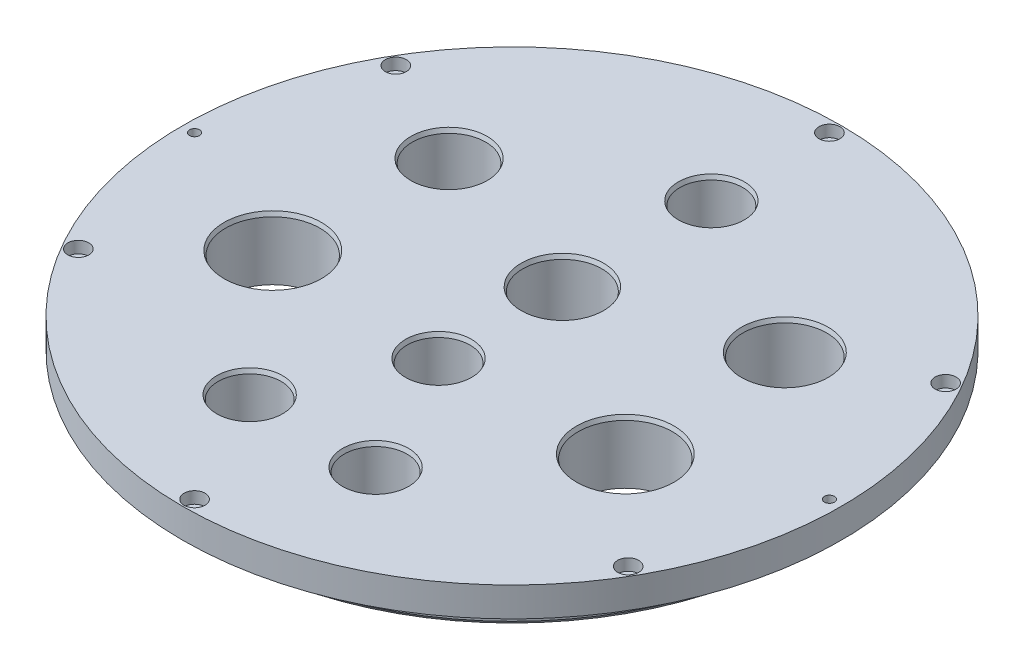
ISO-10303-21;
HEADER;
FILE_DESCRIPTION(('STEP AP214'),'2;1');
FILE_NAME('part.step','',(''),(''),'','','');
FILE_SCHEMA(('AUTOMOTIVE_DESIGN { 1 0 10303 214 1 1 1 1 }'));
ENDSEC;
DATA;
#1=APPLICATION_CONTEXT('core data for automotive mechanical design processes');
#2=APPLICATION_PROTOCOL_DEFINITION('international standard','automotive_design',2000,#1);
#3=PRODUCT_CONTEXT('',#1,'mechanical');
#4=PRODUCT('Part','Part','',(#3));
#5=PRODUCT_RELATED_PRODUCT_CATEGORY('part','',(#4));
#6=PRODUCT_DEFINITION_FORMATION('','',#4);
#7=PRODUCT_DEFINITION_CONTEXT('part definition',#1,'design');
#8=PRODUCT_DEFINITION('design','',#6,#7);
#9=PRODUCT_DEFINITION_SHAPE('','',#8);
#10=(LENGTH_UNIT() NAMED_UNIT(*) SI_UNIT(.MILLI.,.METRE.));
#11=(NAMED_UNIT(*) PLANE_ANGLE_UNIT() SI_UNIT($,.RADIAN.));
#12=(NAMED_UNIT(*) SI_UNIT($,.STERADIAN.) SOLID_ANGLE_UNIT());
#13=UNCERTAINTY_MEASURE_WITH_UNIT(LENGTH_MEASURE(1.E-05),#10,'distance_accuracy_value','');
#14=(GEOMETRIC_REPRESENTATION_CONTEXT(3) GLOBAL_UNCERTAINTY_ASSIGNED_CONTEXT((#13)) GLOBAL_UNIT_ASSIGNED_CONTEXT((#10,
#11,#12)) REPRESENTATION_CONTEXT('',''));
#15=CARTESIAN_POINT('',(0.,0.,0.));
#16=DIRECTION('',(0.,0.,1.));
#17=DIRECTION('',(1.,0.,0.));
#18=AXIS2_PLACEMENT_3D('',#15,#16,#17);
#19=CARTESIAN_POINT('',(83.1818266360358,0.,-48.0250499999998));
#20=DIRECTION('',(0.,1.,0.));
#21=DIRECTION('',(0.,0.,1.));
#22=AXIS2_PLACEMENT_3D('',#19,#20,#21);
#23=CYLINDRICAL_SURFACE('',#22,1.8415);
#24=CARTESIAN_POINT('',(83.1818266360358,10.16,-48.0250499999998));
#25=DIRECTION('',(0.,-1.,0.));
#26=DIRECTION('',(0.,0.,-1.));
#27=AXIS2_PLACEMENT_3D('',#24,#25,#26);
#28=CIRCLE('',#27,1.8415);
#29=CARTESIAN_POINT('',(83.1818266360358,10.16,-49.8665499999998));
#30=VERTEX_POINT('',#29);
#31=EDGE_CURVE('E185',#30,#30,#28,.T.);
#32=ORIENTED_EDGE('',*,*,#31,.T.);
#33=EDGE_LOOP('',(#32));
#34=FACE_BOUND('',#33,.T.);
#35=CARTESIAN_POINT('',(83.1818266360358,15.494,-48.0250499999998));
#36=DIRECTION('',(0.,1.,0.));
#37=DIRECTION('',(0.,0.,1.));
#38=AXIS2_PLACEMENT_3D('',#35,#36,#37);
#39=CIRCLE('',#38,1.8415);
#40=CARTESIAN_POINT('',(83.1818266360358,15.494,-46.1835499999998));
#41=VERTEX_POINT('',#40);
#42=EDGE_CURVE('E108',#41,#41,#39,.F.);
#43=ORIENTED_EDGE('',*,*,#42,.F.);
#44=EDGE_LOOP('',(#43));
#45=FACE_BOUND('',#44,.T.);
#46=ADVANCED_FACE('F41',(#34,#45),#23,.F.);
#47=CARTESIAN_POINT('',(83.1818266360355,0.,48.0250500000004));
#48=DIRECTION('',(0.,1.,0.));
#49=DIRECTION('',(0.,0.,1.));
#50=AXIS2_PLACEMENT_3D('',#47,#48,#49);
#51=CYLINDRICAL_SURFACE('',#50,1.8415);
#52=CARTESIAN_POINT('',(83.1818266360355,10.16,48.0250500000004));
#53=DIRECTION('',(0.,-1.,0.));
#54=DIRECTION('',(0.,0.,-1.));
#55=AXIS2_PLACEMENT_3D('',#52,#53,#54);
#56=CIRCLE('',#55,1.8415);
#57=CARTESIAN_POINT('',(83.1818266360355,10.16,46.1835500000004));
#58=VERTEX_POINT('',#57);
#59=EDGE_CURVE('E188',#58,#58,#56,.T.);
#60=ORIENTED_EDGE('',*,*,#59,.T.);
#61=EDGE_LOOP('',(#60));
#62=FACE_BOUND('',#61,.T.);
#63=CARTESIAN_POINT('',(83.1818266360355,15.494,48.0250500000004));
#64=DIRECTION('',(0.,1.,0.));
#65=DIRECTION('',(0.,0.,1.));
#66=AXIS2_PLACEMENT_3D('',#63,#64,#65);
#67=CIRCLE('',#66,1.8415);
#68=CARTESIAN_POINT('',(83.1818266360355,15.494,49.8665500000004));
#69=VERTEX_POINT('',#68);
#70=EDGE_CURVE('E113',#69,#69,#67,.F.);
#71=ORIENTED_EDGE('',*,*,#70,.F.);
#72=EDGE_LOOP('',(#71));
#73=FACE_BOUND('',#72,.T.);
#74=ADVANCED_FACE('F286',(#62,#73),#51,.F.);
#75=CARTESIAN_POINT('',(0.,0.,96.0501));
#76=DIRECTION('',(0.,1.,0.));
#77=DIRECTION('',(0.,0.,1.));
#78=AXIS2_PLACEMENT_3D('',#75,#76,#77);
#79=CYLINDRICAL_SURFACE('',#78,1.8415);
#80=CARTESIAN_POINT('',(0.,10.16,96.0501));
#81=DIRECTION('',(0.,-1.,0.));
#82=DIRECTION('',(0.,0.,-1.));
#83=AXIS2_PLACEMENT_3D('',#80,#81,#82);
#84=CIRCLE('',#83,1.8415);
#85=CARTESIAN_POINT('',(0.,10.16,94.2086));
#86=VERTEX_POINT('',#85);
#87=EDGE_CURVE('E191',#86,#86,#84,.T.);
#88=ORIENTED_EDGE('',*,*,#87,.T.);
#89=EDGE_LOOP('',(#88));
#90=FACE_BOUND('',#89,.T.);
#91=CARTESIAN_POINT('',(0.,15.494,96.0501));
#92=DIRECTION('',(0.,1.,0.));
#93=DIRECTION('',(0.,0.,1.));
#94=AXIS2_PLACEMENT_3D('',#91,#92,#93);
#95=CIRCLE('',#94,1.8415);
#96=CARTESIAN_POINT('',(0.,15.494,97.8916));
#97=VERTEX_POINT('',#96);
#98=EDGE_CURVE('E118',#97,#97,#95,.F.);
#99=ORIENTED_EDGE('',*,*,#98,.F.);
#100=EDGE_LOOP('',(#99));
#101=FACE_BOUND('',#100,.T.);
#102=ADVANCED_FACE('F292',(#90,#101),#79,.F.);
#103=CARTESIAN_POINT('',(-83.1818266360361,0.,48.0250499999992));
#104=DIRECTION('',(0.,1.,0.));
#105=DIRECTION('',(0.,0.,1.));
#106=AXIS2_PLACEMENT_3D('',#103,#104,#105);
#107=CYLINDRICAL_SURFACE('',#106,1.8415);
#108=CARTESIAN_POINT('',(-83.1818266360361,10.16,48.0250499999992));
#109=DIRECTION('',(0.,-1.,0.));
#110=DIRECTION('',(0.,0.,-1.));
#111=AXIS2_PLACEMENT_3D('',#108,#109,#110);
#112=CIRCLE('',#111,1.8415);
#113=CARTESIAN_POINT('',(-83.1818266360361,10.16,46.1835499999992));
#114=VERTEX_POINT('',#113);
#115=EDGE_CURVE('E194',#114,#114,#112,.T.);
#116=ORIENTED_EDGE('',*,*,#115,.T.);
#117=EDGE_LOOP('',(#116));
#118=FACE_BOUND('',#117,.T.);
#119=CARTESIAN_POINT('',(-83.1818266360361,15.494,48.0250499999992));
#120=DIRECTION('',(0.,1.,0.));
#121=DIRECTION('',(0.,0.,1.));
#122=AXIS2_PLACEMENT_3D('',#119,#120,#121);
#123=CIRCLE('',#122,1.8415);
#124=CARTESIAN_POINT('',(-83.1818266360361,15.494,49.8665499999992));
#125=VERTEX_POINT('',#124);
#126=EDGE_CURVE('E123',#125,#125,#123,.F.);
#127=ORIENTED_EDGE('',*,*,#126,.F.);
#128=EDGE_LOOP('',(#127));
#129=FACE_BOUND('',#128,.T.);
#130=ADVANCED_FACE('F452',(#118,#129),#107,.F.);
#131=CARTESIAN_POINT('',(-83.1818266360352,0.,-48.025050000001));
#132=DIRECTION('',(0.,1.,0.));
#133=DIRECTION('',(0.,0.,1.));
#134=AXIS2_PLACEMENT_3D('',#131,#132,#133);
#135=CYLINDRICAL_SURFACE('',#134,1.8415);
#136=CARTESIAN_POINT('',(-83.1818266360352,10.16,-48.025050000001));
#137=DIRECTION('',(0.,-1.,0.));
#138=DIRECTION('',(0.,0.,-1.));
#139=AXIS2_PLACEMENT_3D('',#136,#137,#138);
#140=CIRCLE('',#139,1.8415);
#141=CARTESIAN_POINT('',(-83.1818266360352,10.16,-49.866550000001));
#142=VERTEX_POINT('',#141);
#143=EDGE_CURVE('E136',#142,#142,#140,.T.);
#144=ORIENTED_EDGE('',*,*,#143,.T.);
#145=EDGE_LOOP('',(#144));
#146=FACE_BOUND('',#145,.T.);
#147=CARTESIAN_POINT('',(-83.1818266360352,15.494,-48.025050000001));
#148=DIRECTION('',(0.,1.,0.));
#149=DIRECTION('',(0.,0.,1.));
#150=AXIS2_PLACEMENT_3D('',#147,#148,#149);
#151=CIRCLE('',#150,1.8415);
#152=CARTESIAN_POINT('',(-83.1818266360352,15.494,-46.183550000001));
#153=VERTEX_POINT('',#152);
#154=EDGE_CURVE('E128',#153,#153,#151,.F.);
#155=ORIENTED_EDGE('',*,*,#154,.F.);
#156=EDGE_LOOP('',(#155));
#157=FACE_BOUND('',#156,.T.);
#158=ADVANCED_FACE('F301',(#146,#157),#135,.F.);
#159=CARTESIAN_POINT('',(0.,0.,-96.0501));
#160=DIRECTION('',(0.,1.,0.));
#161=DIRECTION('',(0.,0.,1.));
#162=AXIS2_PLACEMENT_3D('',#159,#160,#161);
#163=CYLINDRICAL_SURFACE('',#162,1.8415);
#164=CARTESIAN_POINT('',(0.,10.16,-96.0501));
#165=DIRECTION('',(0.,-1.,0.));
#166=DIRECTION('',(0.,0.,-1.));
#167=AXIS2_PLACEMENT_3D('',#164,#165,#166);
#168=CIRCLE('',#167,1.8415);
#169=CARTESIAN_POINT('',(0.,10.16,-97.8916));
#170=VERTEX_POINT('',#169);
#171=EDGE_CURVE('E182',#170,#170,#168,.T.);
#172=ORIENTED_EDGE('',*,*,#171,.T.);
#173=EDGE_LOOP('',(#172));
#174=FACE_BOUND('',#173,.T.);
#175=CARTESIAN_POINT('',(0.,15.494,-96.0501));
#176=DIRECTION('',(0.,1.,0.));
#177=DIRECTION('',(0.,0.,1.));
#178=AXIS2_PLACEMENT_3D('',#175,#176,#177);
#179=CIRCLE('',#178,1.8415);
#180=CARTESIAN_POINT('',(0.,15.494,-94.2086));
#181=VERTEX_POINT('',#180);
#182=EDGE_CURVE('E133',#181,#181,#179,.F.);
#183=ORIENTED_EDGE('',*,*,#182,.F.);
#184=EDGE_LOOP('',(#183));
#185=FACE_BOUND('',#184,.T.);
#186=ADVANCED_FACE('F298',(#174,#185),#163,.F.);
#187=CARTESIAN_POINT('',(0.,0.,0.));
#188=DIRECTION('',(0.,-1.,0.));
#189=DIRECTION('',(0.,0.,-1.));
#190=AXIS2_PLACEMENT_3D('',#187,#188,#189);
#191=PLANE('',#190);
#192=CARTESIAN_POINT('',(0.,0.,-60.325));
#193=DIRECTION('',(0.,1.,0.));
#194=DIRECTION('',(0.,0.,1.));
#195=AXIS2_PLACEMENT_3D('',#192,#193,#194);
#196=CIRCLE('',#195,9.525);
#197=CARTESIAN_POINT('',(0.,0.,-50.8));
#198=VERTEX_POINT('',#197);
#199=EDGE_CURVE('E262',#198,#198,#196,.T.);
#200=ORIENTED_EDGE('',*,*,#199,.T.);
#201=EDGE_LOOP('',(#200));
#202=FACE_BOUND('',#201,.T.);
#203=CARTESIAN_POINT('',(0.,0.,22.225));
#204=DIRECTION('',(0.,1.,0.));
#205=DIRECTION('',(0.,0.,1.));
#206=AXIS2_PLACEMENT_3D('',#203,#204,#205);
#207=CIRCLE('',#206,9.525);
#208=CARTESIAN_POINT('',(0.,0.,31.75));
#209=VERTEX_POINT('',#208);
#210=EDGE_CURVE('E258',#209,#209,#207,.T.);
#211=ORIENTED_EDGE('',*,*,#210,.T.);
#212=EDGE_LOOP('',(#211));
#213=FACE_BOUND('',#212,.T.);
#214=CARTESIAN_POINT('',(0.,0.,-15.24));
#215=DIRECTION('',(0.,1.,0.));
#216=DIRECTION('',(0.,0.,1.));
#217=AXIS2_PLACEMENT_3D('',#214,#215,#216);
#218=CIRCLE('',#217,12.);
#219=CARTESIAN_POINT('',(0.,0.,-3.23999999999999));
#220=VERTEX_POINT('',#219);
#221=EDGE_CURVE('E255',#220,#220,#218,.T.);
#222=ORIENTED_EDGE('',*,*,#221,.T.);
#223=EDGE_LOOP('',(#222));
#224=FACE_BOUND('',#223,.T.);
#225=CARTESIAN_POINT('',(-19.05,0.,60.325));
#226=DIRECTION('',(0.,1.,0.));
#227=DIRECTION('',(0.,0.,1.));
#228=AXIS2_PLACEMENT_3D('',#225,#226,#227);
#229=CIRCLE('',#228,9.52500000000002);
#230=CARTESIAN_POINT('',(-19.05,0.,69.85));
#231=VERTEX_POINT('',#230);
#232=EDGE_CURVE('E251',#231,#231,#229,.T.);
#233=ORIENTED_EDGE('',*,*,#232,.T.);
#234=EDGE_LOOP('',(#233));
#235=FACE_BOUND('',#234,.T.);
#236=CARTESIAN_POINT('',(19.05,0.,60.325));
#237=DIRECTION('',(0.,1.,0.));
#238=DIRECTION('',(0.,0.,1.));
#239=AXIS2_PLACEMENT_3D('',#236,#237,#238);
#240=CIRCLE('',#239,9.525);
#241=CARTESIAN_POINT('',(19.05,0.,69.85));
#242=VERTEX_POINT('',#241);
#243=EDGE_CURVE('E248',#242,#242,#240,.T.);
#244=ORIENTED_EDGE('',*,*,#243,.T.);
#245=EDGE_LOOP('',(#244));
#246=FACE_BOUND('',#245,.T.);
#247=CARTESIAN_POINT('',(-50.8,0.,-31.75));
#248=DIRECTION('',(0.,1.,0.));
#249=DIRECTION('',(0.,0.,1.));
#250=AXIS2_PLACEMENT_3D('',#247,#248,#249);
#251=CIRCLE('',#250,11.1125);
#252=CARTESIAN_POINT('',(-50.8,0.,-20.6375));
#253=VERTEX_POINT('',#252);
#254=EDGE_CURVE('E245',#253,#253,#251,.T.);
#255=ORIENTED_EDGE('',*,*,#254,.T.);
#256=EDGE_LOOP('',(#255));
#257=FACE_BOUND('',#256,.T.);
#258=CARTESIAN_POINT('',(50.8,0.,-31.75));
#259=DIRECTION('',(0.,1.,0.));
#260=DIRECTION('',(0.,0.,1.));
#261=AXIS2_PLACEMENT_3D('',#258,#259,#260);
#262=CIRCLE('',#261,12.7);
#263=CARTESIAN_POINT('',(50.8,0.,-19.05));
#264=VERTEX_POINT('',#263);
#265=EDGE_CURVE('E242',#264,#264,#262,.T.);
#266=ORIENTED_EDGE('',*,*,#265,.T.);
#267=EDGE_LOOP('',(#266));
#268=FACE_BOUND('',#267,.T.);
#269=CARTESIAN_POINT('',(53.34,0.,19.05));
#270=DIRECTION('',(0.,1.,0.));
#271=DIRECTION('',(0.,0.,1.));
#272=AXIS2_PLACEMENT_3D('',#269,#270,#271);
#273=CIRCLE('',#272,14.2875);
#274=CARTESIAN_POINT('',(53.34,0.,33.3375));
#275=VERTEX_POINT('',#274);
#276=EDGE_CURVE('E239',#275,#275,#273,.T.);
#277=ORIENTED_EDGE('',*,*,#276,.T.);
#278=EDGE_LOOP('',(#277));
#279=FACE_BOUND('',#278,.T.);
#280=CARTESIAN_POINT('',(-53.34,0.,19.05));
#281=DIRECTION('',(0.,1.,0.));
#282=DIRECTION('',(0.,0.,1.));
#283=AXIS2_PLACEMENT_3D('',#280,#281,#282);
#284=CIRCLE('',#283,14.2875);
#285=CARTESIAN_POINT('',(-53.34,0.,33.3375));
#286=VERTEX_POINT('',#285);
#287=EDGE_CURVE('E236',#286,#286,#284,.T.);
#288=ORIENTED_EDGE('',*,*,#287,.T.);
#289=EDGE_LOOP('',(#288));
#290=FACE_BOUND('',#289,.T.);
#291=CARTESIAN_POINT('',(0.,0.,0.));
#292=DIRECTION('',(0.,-1.,0.));
#293=DIRECTION('',(0.,0.,-1.));
#294=AXIS2_PLACEMENT_3D('',#291,#292,#293);
#295=CIRCLE('',#294,86.8725590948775);
#296=CARTESIAN_POINT('',(0.,0.,-86.8725590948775));
#297=VERTEX_POINT('',#296);
#298=EDGE_CURVE('E141',#297,#297,#295,.T.);
#299=ORIENTED_EDGE('',*,*,#298,.T.);
#300=EDGE_LOOP('',(#299));
#301=FACE_BOUND('',#300,.T.);
#302=ADVANCED_FACE('F266',(#202,#213,#224,#235,#246,#257,#268,#279,#290,#301),#191,.T.);
#303=CARTESIAN_POINT('',(0.,0.,0.));
#304=DIRECTION('',(0.,-1.,0.));
#305=DIRECTION('',(0.,0.,-1.));
#306=AXIS2_PLACEMENT_3D('',#303,#304,#305);
#307=CYLINDRICAL_SURFACE('',#306,87.3125);
#308=CARTESIAN_POINT('',(0.,0.761999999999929,0.));
#309=DIRECTION('',(0.,-1.,0.));
#310=DIRECTION('',(0.,0.,-1.));
#311=AXIS2_PLACEMENT_3D('',#308,#309,#310);
#312=CIRCLE('',#311,87.3125);
#313=CARTESIAN_POINT('',(0.,0.761999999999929,-87.3125));
#314=VERTEX_POINT('',#313);
#315=EDGE_CURVE('E107',#314,#314,#312,.F.);
#316=ORIENTED_EDGE('',*,*,#315,.T.);
#317=EDGE_LOOP('',(#316));
#318=FACE_BOUND('',#317,.T.);
#319=CARTESIAN_POINT('',(0.,2.3622,0.));
#320=DIRECTION('',(0.,-1.,0.));
#321=DIRECTION('',(0.,0.,-1.));
#322=AXIS2_PLACEMENT_3D('',#319,#320,#321);
#323=CIRCLE('',#322,87.3125);
#324=CARTESIAN_POINT('',(0.,2.3622,-87.3125));
#325=VERTEX_POINT('',#324);
#326=EDGE_CURVE('E145',#325,#325,#323,.T.);
#327=ORIENTED_EDGE('',*,*,#326,.T.);
#328=EDGE_LOOP('',(#327));
#329=FACE_BOUND('',#328,.T.);
#330=ADVANCED_FACE('F347',(#318,#329),#307,.T.);
#331=CARTESIAN_POINT('',(87.3125,2.3622,0.));
#332=DIRECTION('',(0.,1.,0.));
#333=DIRECTION('',(0.,0.,1.));
#334=AXIS2_PLACEMENT_3D('',#331,#332,#333);
#335=PLANE('',#334);
#336=CARTESIAN_POINT('',(0.,2.3622,0.));
#337=DIRECTION('',(0.,-1.,0.));
#338=DIRECTION('',(0.,0.,-1.));
#339=AXIS2_PLACEMENT_3D('',#336,#337,#338);
#340=CIRCLE('',#339,84.4931);
#341=CARTESIAN_POINT('',(0.,2.3622,-84.4931));
#342=VERTEX_POINT('',#341);
#343=EDGE_CURVE('E149',#342,#342,#340,.T.);
#344=ORIENTED_EDGE('',*,*,#343,.T.);
#345=EDGE_LOOP('',(#344));
#346=FACE_BOUND('',#345,.T.);
#347=ORIENTED_EDGE('',*,*,#326,.F.);
#348=EDGE_LOOP('',(#347));
#349=FACE_BOUND('',#348,.T.);
#350=ADVANCED_FACE('F343',(#346,#349),#335,.T.);
#351=CARTESIAN_POINT('',(0.,0.,0.));
#352=DIRECTION('',(0.,-1.,0.));
#353=DIRECTION('',(0.,0.,-1.));
#354=AXIS2_PLACEMENT_3D('',#351,#352,#353);
#355=CYLINDRICAL_SURFACE('',#354,84.4931);
#356=CARTESIAN_POINT('',(0.,7.1628,0.));
#357=DIRECTION('',(0.,-1.,0.));
#358=DIRECTION('',(0.,0.,-1.));
#359=AXIS2_PLACEMENT_3D('',#356,#357,#358);
#360=CIRCLE('',#359,84.4931);
#361=CARTESIAN_POINT('',(0.,7.1628,-84.4931));
#362=VERTEX_POINT('',#361);
#363=EDGE_CURVE('E153',#362,#362,#360,.T.);
#364=ORIENTED_EDGE('',*,*,#363,.T.);
#365=EDGE_LOOP('',(#364));
#366=FACE_BOUND('',#365,.T.);
#367=ORIENTED_EDGE('',*,*,#343,.F.);
#368=EDGE_LOOP('',(#367));
#369=FACE_BOUND('',#368,.T.);
#370=ADVANCED_FACE('F339',(#366,#369),#355,.T.);
#371=CARTESIAN_POINT('',(84.4931,7.1628,0.));
#372=DIRECTION('',(0.,-1.,0.));
#373=DIRECTION('',(0.,0.,-1.));
#374=AXIS2_PLACEMENT_3D('',#371,#372,#373);
#375=PLANE('',#374);
#376=CARTESIAN_POINT('',(0.,7.1628,0.));
#377=DIRECTION('',(0.,-1.,0.));
#378=DIRECTION('',(0.,0.,-1.));
#379=AXIS2_PLACEMENT_3D('',#376,#377,#378);
#380=CIRCLE('',#379,87.3125);
#381=CARTESIAN_POINT('',(0.,7.1628,-87.3125));
#382=VERTEX_POINT('',#381);
#383=EDGE_CURVE('E157',#382,#382,#380,.T.);
#384=ORIENTED_EDGE('',*,*,#383,.T.);
#385=EDGE_LOOP('',(#384));
#386=FACE_BOUND('',#385,.T.);
#387=ORIENTED_EDGE('',*,*,#363,.F.);
#388=EDGE_LOOP('',(#387));
#389=FACE_BOUND('',#388,.T.);
#390=ADVANCED_FACE('F335',(#386,#389),#375,.T.);
#391=CARTESIAN_POINT('',(0.,0.,0.));
#392=DIRECTION('',(0.,-1.,0.));
#393=DIRECTION('',(0.,0.,-1.));
#394=AXIS2_PLACEMENT_3D('',#391,#392,#393);
#395=CYLINDRICAL_SURFACE('',#394,87.3125);
#396=CARTESIAN_POINT('',(0.,10.16,0.));
#397=DIRECTION('',(0.,-1.,0.));
#398=DIRECTION('',(0.,0.,-1.));
#399=AXIS2_PLACEMENT_3D('',#396,#397,#398);
#400=CIRCLE('',#399,87.3125);
#401=CARTESIAN_POINT('',(0.,10.16,-87.3125));
#402=VERTEX_POINT('',#401);
#403=EDGE_CURVE('E161',#402,#402,#400,.T.);
#404=ORIENTED_EDGE('',*,*,#403,.T.);
#405=EDGE_LOOP('',(#404));
#406=FACE_BOUND('',#405,.T.);
#407=ORIENTED_EDGE('',*,*,#383,.F.);
#408=EDGE_LOOP('',(#407));
#409=FACE_BOUND('',#408,.T.);
#410=ADVANCED_FACE('F331',(#406,#409),#395,.T.);
#411=CARTESIAN_POINT('',(87.3125,10.16,0.));
#412=DIRECTION('',(0.,-1.,0.));
#413=DIRECTION('',(0.,0.,-1.));
#414=AXIS2_PLACEMENT_3D('',#411,#412,#413);
#415=PLANE('',#414);
#416=CARTESIAN_POINT('',(0.,10.16,0.));
#417=DIRECTION('',(0.,-1.,0.));
#418=DIRECTION('',(0.,0.,-1.));
#419=AXIS2_PLACEMENT_3D('',#416,#417,#418);
#420=CIRCLE('',#419,88.7349);
#421=CARTESIAN_POINT('',(0.,10.16,-88.7349));
#422=VERTEX_POINT('',#421);
#423=EDGE_CURVE('E164',#422,#422,#420,.T.);
#424=ORIENTED_EDGE('',*,*,#423,.T.);
#425=EDGE_LOOP('',(#424));
#426=FACE_BOUND('',#425,.T.);
#427=ORIENTED_EDGE('',*,*,#403,.F.);
#428=EDGE_LOOP('',(#427));
#429=FACE_BOUND('',#428,.T.);
#430=ADVANCED_FACE('F327',(#426,#429),#415,.T.);
#431=CARTESIAN_POINT('',(0.,0.,0.));
#432=DIRECTION('',(0.,-1.,0.));
#433=DIRECTION('',(0.,0.,-1.));
#434=AXIS2_PLACEMENT_3D('',#431,#432,#433);
#435=CYLINDRICAL_SURFACE('',#434,88.7349);
#436=CARTESIAN_POINT('',(0.,12.1158,0.));
#437=DIRECTION('',(0.,-1.,0.));
#438=DIRECTION('',(0.,0.,-1.));
#439=AXIS2_PLACEMENT_3D('',#436,#437,#438);
#440=CIRCLE('',#439,88.7349);
#441=CARTESIAN_POINT('',(0.,12.1158,-88.7349));
#442=VERTEX_POINT('',#441);
#443=EDGE_CURVE('E167',#442,#442,#440,.T.);
#444=ORIENTED_EDGE('',*,*,#443,.T.);
#445=EDGE_LOOP('',(#444));
#446=FACE_BOUND('',#445,.T.);
#447=ORIENTED_EDGE('',*,*,#423,.F.);
#448=EDGE_LOOP('',(#447));
#449=FACE_BOUND('',#448,.T.);
#450=ADVANCED_FACE('F323',(#446,#449),#435,.T.);
#451=CARTESIAN_POINT('',(88.7349,12.1158,0.));
#452=DIRECTION('',(0.,-1.,0.));
#453=DIRECTION('',(0.,0.,-1.));
#454=AXIS2_PLACEMENT_3D('',#451,#452,#453);
#455=PLANE('',#454);
#456=CARTESIAN_POINT('',(0.,12.1158,0.));
#457=DIRECTION('',(0.,-1.,0.));
#458=DIRECTION('',(0.,0.,-1.));
#459=AXIS2_PLACEMENT_3D('',#456,#457,#458);
#460=CIRCLE('',#459,92.2655);
#461=CARTESIAN_POINT('',(0.,12.1158,-92.2655));
#462=VERTEX_POINT('',#461);
#463=EDGE_CURVE('E170',#462,#462,#460,.T.);
#464=ORIENTED_EDGE('',*,*,#463,.T.);
#465=EDGE_LOOP('',(#464));
#466=FACE_BOUND('',#465,.T.);
#467=ORIENTED_EDGE('',*,*,#443,.F.);
#468=EDGE_LOOP('',(#467));
#469=FACE_BOUND('',#468,.T.);
#470=ADVANCED_FACE('F319',(#466,#469),#455,.T.);
#471=CARTESIAN_POINT('',(0.,0.,0.));
#472=DIRECTION('',(0.,-1.,0.));
#473=DIRECTION('',(0.,0.,-1.));
#474=AXIS2_PLACEMENT_3D('',#471,#472,#473);
#475=CYLINDRICAL_SURFACE('',#474,92.2655);
#476=CARTESIAN_POINT('',(0.,10.16,0.));
#477=DIRECTION('',(0.,-1.,0.));
#478=DIRECTION('',(0.,0.,-1.));
#479=AXIS2_PLACEMENT_3D('',#476,#477,#478);
#480=CIRCLE('',#479,92.2655);
#481=CARTESIAN_POINT('',(0.,10.16,-92.2655));
#482=VERTEX_POINT('',#481);
#483=EDGE_CURVE('E173',#482,#482,#480,.T.);
#484=ORIENTED_EDGE('',*,*,#483,.T.);
#485=EDGE_LOOP('',(#484));
#486=FACE_BOUND('',#485,.T.);
#487=ORIENTED_EDGE('',*,*,#463,.F.);
#488=EDGE_LOOP('',(#487));
#489=FACE_BOUND('',#488,.T.);
#490=ADVANCED_FACE('F315',(#486,#489),#475,.F.);
#491=CARTESIAN_POINT('',(92.2655,10.16,0.));
#492=DIRECTION('',(0.,-1.,0.));
#493=DIRECTION('',(0.,0.,-1.));
#494=AXIS2_PLACEMENT_3D('',#491,#492,#493);
#495=PLANE('',#494);
#496=CARTESIAN_POINT('',(-96.0501,10.16,0.));
#497=DIRECTION('',(0.,-1.,0.));
#498=DIRECTION('',(0.,0.,-1.));
#499=AXIS2_PLACEMENT_3D('',#496,#497,#498);
#500=CIRCLE('',#499,1.52399999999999);
#501=CARTESIAN_POINT('',(-96.0501,10.16,-1.52399999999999));
#502=VERTEX_POINT('',#501);
#503=EDGE_CURVE('E230',#502,#502,#500,.T.);
#504=ORIENTED_EDGE('',*,*,#503,.F.);
#505=EDGE_LOOP('',(#504));
#506=FACE_BOUND('',#505,.T.);
#507=CARTESIAN_POINT('',(96.0501,10.16,0.));
#508=DIRECTION('',(0.,-1.,0.));
#509=DIRECTION('',(0.,0.,-1.));
#510=AXIS2_PLACEMENT_3D('',#507,#508,#509);
#511=CIRCLE('',#510,1.52399999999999);
#512=CARTESIAN_POINT('',(96.0501,10.16,-1.52399999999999));
#513=VERTEX_POINT('',#512);
#514=EDGE_CURVE('E222',#513,#513,#511,.T.);
#515=ORIENTED_EDGE('',*,*,#514,.F.);
#516=EDGE_LOOP('',(#515));
#517=FACE_BOUND('',#516,.T.);
#518=ORIENTED_EDGE('',*,*,#143,.F.);
#519=EDGE_LOOP('',(#518));
#520=FACE_BOUND('',#519,.T.);
#521=ORIENTED_EDGE('',*,*,#115,.F.);
#522=EDGE_LOOP('',(#521));
#523=FACE_BOUND('',#522,.T.);
#524=ORIENTED_EDGE('',*,*,#87,.F.);
#525=EDGE_LOOP('',(#524));
#526=FACE_BOUND('',#525,.T.);
#527=ORIENTED_EDGE('',*,*,#59,.F.);
#528=EDGE_LOOP('',(#527));
#529=FACE_BOUND('',#528,.T.);
#530=ORIENTED_EDGE('',*,*,#31,.F.);
#531=EDGE_LOOP('',(#530));
#532=FACE_BOUND('',#531,.T.);
#533=ORIENTED_EDGE('',*,*,#171,.F.);
#534=EDGE_LOOP('',(#533));
#535=FACE_BOUND('',#534,.T.);
#536=CARTESIAN_POINT('',(0.,10.16,0.));
#537=DIRECTION('',(0.,-1.,0.));
#538=DIRECTION('',(0.,0.,-1.));
#539=AXIS2_PLACEMENT_3D('',#536,#537,#538);
#540=CIRCLE('',#539,99.7204);
#541=CARTESIAN_POINT('',(0.,10.16,-99.7204));
#542=VERTEX_POINT('',#541);
#543=EDGE_CURVE('E176',#542,#542,#540,.T.);
#544=ORIENTED_EDGE('',*,*,#543,.T.);
#545=EDGE_LOOP('',(#544));
#546=FACE_BOUND('',#545,.T.);
#547=ORIENTED_EDGE('',*,*,#483,.F.);
#548=EDGE_LOOP('',(#547));
#549=FACE_BOUND('',#548,.T.);
#550=ADVANCED_FACE('F311',(#506,#517,#520,#523,#526,#529,#532,#535,#546,#549),#495,.T.);
#551=CARTESIAN_POINT('',(0.,0.,0.));
#552=DIRECTION('',(0.,-1.,0.));
#553=DIRECTION('',(0.,0.,-1.));
#554=AXIS2_PLACEMENT_3D('',#551,#552,#553);
#555=CYLINDRICAL_SURFACE('',#554,99.7204);
#556=CARTESIAN_POINT('',(0.,19.05,0.));
#557=DIRECTION('',(0.,-1.,0.));
#558=DIRECTION('',(0.,0.,-1.));
#559=AXIS2_PLACEMENT_3D('',#556,#557,#558);
#560=CIRCLE('',#559,99.7204);
#561=CARTESIAN_POINT('',(0.,19.05,-99.7204));
#562=VERTEX_POINT('',#561);
#563=EDGE_CURVE('E179',#562,#562,#560,.T.);
#564=ORIENTED_EDGE('',*,*,#563,.T.);
#565=EDGE_LOOP('',(#564));
#566=FACE_BOUND('',#565,.T.);
#567=ORIENTED_EDGE('',*,*,#543,.F.);
#568=EDGE_LOOP('',(#567));
#569=FACE_BOUND('',#568,.T.);
#570=ADVANCED_FACE('F307',(#566,#569),#555,.T.);
#571=CARTESIAN_POINT('',(99.7204,19.05,0.));
#572=DIRECTION('',(0.,1.,0.));
#573=DIRECTION('',(0.,0.,1.));
#574=AXIS2_PLACEMENT_3D('',#571,#572,#573);
#575=PLANE('',#574);
#576=CARTESIAN_POINT('',(0.,19.05,-60.325));
#577=DIRECTION('',(0.,1.,0.));
#578=DIRECTION('',(0.,0.,1.));
#579=AXIS2_PLACEMENT_3D('',#576,#577,#578);
#580=CIRCLE('',#579,9.98724219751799);
#581=CARTESIAN_POINT('',(0.,19.05,-50.337757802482));
#582=VERTEX_POINT('',#581);
#583=EDGE_CURVE('E77',#582,#582,#580,.F.);
#584=ORIENTED_EDGE('',*,*,#583,.T.);
#585=EDGE_LOOP('',(#584));
#586=FACE_BOUND('',#585,.T.);
#587=CARTESIAN_POINT('',(0.,19.05,22.225));
#588=DIRECTION('',(0.,1.,0.));
#589=DIRECTION('',(0.,0.,1.));
#590=AXIS2_PLACEMENT_3D('',#587,#588,#589);
#591=CIRCLE('',#590,9.98724219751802);
#592=CARTESIAN_POINT('',(0.,19.05,32.212242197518));
#593=VERTEX_POINT('',#592);
#594=EDGE_CURVE('E80',#593,#593,#591,.F.);
#595=ORIENTED_EDGE('',*,*,#594,.T.);
#596=EDGE_LOOP('',(#595));
#597=FACE_BOUND('',#596,.T.);
#598=CARTESIAN_POINT('',(19.05,19.05,60.325));
#599=DIRECTION('',(0.,1.,0.));
#600=DIRECTION('',(0.,0.,1.));
#601=AXIS2_PLACEMENT_3D('',#598,#599,#600);
#602=CIRCLE('',#601,9.98724219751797);
#603=CARTESIAN_POINT('',(19.05,19.05,70.312242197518));
#604=VERTEX_POINT('',#603);
#605=EDGE_CURVE('E83',#604,#604,#602,.F.);
#606=ORIENTED_EDGE('',*,*,#605,.T.);
#607=EDGE_LOOP('',(#606));
#608=FACE_BOUND('',#607,.T.);
#609=CARTESIAN_POINT('',(-53.34,19.05,19.05));
#610=DIRECTION('',(0.,1.,0.));
#611=DIRECTION('',(0.,0.,1.));
#612=AXIS2_PLACEMENT_3D('',#609,#610,#611);
#613=CIRCLE('',#612,14.7497421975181);
#614=CARTESIAN_POINT('',(-53.34,19.05,33.7997421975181));
#615=VERTEX_POINT('',#614);
#616=EDGE_CURVE('E86',#615,#615,#613,.F.);
#617=ORIENTED_EDGE('',*,*,#616,.T.);
#618=EDGE_LOOP('',(#617));
#619=FACE_BOUND('',#618,.T.);
#620=CARTESIAN_POINT('',(53.34,19.05,19.05));
#621=DIRECTION('',(0.,1.,0.));
#622=DIRECTION('',(0.,0.,1.));
#623=AXIS2_PLACEMENT_3D('',#620,#621,#622);
#624=CIRCLE('',#623,14.7497421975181);
#625=CARTESIAN_POINT('',(53.34,19.05,33.7997421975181));
#626=VERTEX_POINT('',#625);
#627=EDGE_CURVE('E89',#626,#626,#624,.F.);
#628=ORIENTED_EDGE('',*,*,#627,.T.);
#629=EDGE_LOOP('',(#628));
#630=FACE_BOUND('',#629,.T.);
#631=CARTESIAN_POINT('',(-19.05,19.05,60.325));
#632=DIRECTION('',(0.,1.,0.));
#633=DIRECTION('',(0.,0.,1.));
#634=AXIS2_PLACEMENT_3D('',#631,#632,#633);
#635=CIRCLE('',#634,9.98724219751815);
#636=CARTESIAN_POINT('',(-19.05,19.05,70.3122421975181));
#637=VERTEX_POINT('',#636);
#638=EDGE_CURVE('E92',#637,#637,#635,.F.);
#639=ORIENTED_EDGE('',*,*,#638,.T.);
#640=EDGE_LOOP('',(#639));
#641=FACE_BOUND('',#640,.T.);
#642=CARTESIAN_POINT('',(0.,19.05,-15.24));
#643=DIRECTION('',(0.,1.,0.));
#644=DIRECTION('',(0.,0.,1.));
#645=AXIS2_PLACEMENT_3D('',#642,#643,#644);
#646=CIRCLE('',#645,12.4622421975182);
#647=CARTESIAN_POINT('',(0.,19.05,-2.77775780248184));
#648=VERTEX_POINT('',#647);
#649=EDGE_CURVE('E95',#648,#648,#646,.F.);
#650=ORIENTED_EDGE('',*,*,#649,.T.);
#651=EDGE_LOOP('',(#650));
#652=FACE_BOUND('',#651,.T.);
#653=CARTESIAN_POINT('',(-50.8,19.05,-31.75));
#654=DIRECTION('',(0.,1.,0.));
#655=DIRECTION('',(0.,0.,1.));
#656=AXIS2_PLACEMENT_3D('',#653,#654,#655);
#657=CIRCLE('',#656,11.5747421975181);
#658=CARTESIAN_POINT('',(-50.8,19.05,-20.1752578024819));
#659=VERTEX_POINT('',#658);
#660=EDGE_CURVE('E98',#659,#659,#657,.F.);
#661=ORIENTED_EDGE('',*,*,#660,.T.);
#662=EDGE_LOOP('',(#661));
#663=FACE_BOUND('',#662,.T.);
#664=CARTESIAN_POINT('',(50.8,19.05,-31.75));
#665=DIRECTION('',(0.,1.,0.));
#666=DIRECTION('',(0.,0.,1.));
#667=AXIS2_PLACEMENT_3D('',#664,#665,#666);
#668=CIRCLE('',#667,13.1622421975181);
#669=CARTESIAN_POINT('',(50.8,19.05,-18.5877578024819));
#670=VERTEX_POINT('',#669);
#671=EDGE_CURVE('E101',#670,#670,#668,.F.);
#672=ORIENTED_EDGE('',*,*,#671,.T.);
#673=EDGE_LOOP('',(#672));
#674=FACE_BOUND('',#673,.T.);
#675=CARTESIAN_POINT('',(-96.0501,19.05,0.));
#676=DIRECTION('',(0.,1.,0.));
#677=DIRECTION('',(0.,0.,1.));
#678=AXIS2_PLACEMENT_3D('',#675,#676,#677);
#679=CIRCLE('',#678,1.52399999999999);
#680=CARTESIAN_POINT('',(-96.0501,19.05,1.52399999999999));
#681=VERTEX_POINT('',#680);
#682=EDGE_CURVE('E233',#681,#681,#679,.T.);
#683=ORIENTED_EDGE('',*,*,#682,.F.);
#684=EDGE_LOOP('',(#683));
#685=FACE_BOUND('',#684,.T.);
#686=CARTESIAN_POINT('',(96.0501,19.05,0.));
#687=DIRECTION('',(0.,1.,0.));
#688=DIRECTION('',(0.,0.,1.));
#689=AXIS2_PLACEMENT_3D('',#686,#687,#688);
#690=CIRCLE('',#689,1.52399999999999);
#691=CARTESIAN_POINT('',(96.0501,19.05,1.52399999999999));
#692=VERTEX_POINT('',#691);
#693=EDGE_CURVE('E227',#692,#692,#690,.T.);
#694=ORIENTED_EDGE('',*,*,#693,.F.);
#695=EDGE_LOOP('',(#694));
#696=FACE_BOUND('',#695,.T.);
#697=CARTESIAN_POINT('',(83.1818266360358,19.05,-48.0250499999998));
#698=DIRECTION('',(0.,1.,0.));
#699=DIRECTION('',(0.,0.,1.));
#700=AXIS2_PLACEMENT_3D('',#697,#698,#699);
#701=CIRCLE('',#700,3.175);
#702=CARTESIAN_POINT('',(83.1818266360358,19.05,-44.8500499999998));
#703=VERTEX_POINT('',#702);
#704=EDGE_CURVE('E219',#703,#703,#701,.T.);
#705=ORIENTED_EDGE('',*,*,#704,.F.);
#706=EDGE_LOOP('',(#705));
#707=FACE_BOUND('',#706,.T.);
#708=CARTESIAN_POINT('',(83.1818266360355,19.05,48.0250500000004));
#709=DIRECTION('',(0.,1.,0.));
#710=DIRECTION('',(0.,0.,1.));
#711=AXIS2_PLACEMENT_3D('',#708,#709,#710);
#712=CIRCLE('',#711,3.175);
#713=CARTESIAN_POINT('',(83.1818266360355,19.05,51.2000500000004));
#714=VERTEX_POINT('',#713);
#715=EDGE_CURVE('E111',#714,#714,#712,.T.);
#716=ORIENTED_EDGE('',*,*,#715,.F.);
#717=EDGE_LOOP('',(#716));
#718=FACE_BOUND('',#717,.T.);
#719=CARTESIAN_POINT('',(0.,19.05,96.0501));
#720=DIRECTION('',(0.,1.,0.));
#721=DIRECTION('',(0.,0.,1.));
#722=AXIS2_PLACEMENT_3D('',#719,#720,#721);
#723=CIRCLE('',#722,3.175);
#724=CARTESIAN_POINT('',(0.,19.05,99.2251));
#725=VERTEX_POINT('',#724);
#726=EDGE_CURVE('E116',#725,#725,#723,.T.);
#727=ORIENTED_EDGE('',*,*,#726,.F.);
#728=EDGE_LOOP('',(#727));
#729=FACE_BOUND('',#728,.T.);
#730=CARTESIAN_POINT('',(-83.1818266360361,19.05,48.0250499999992));
#731=DIRECTION('',(0.,1.,0.));
#732=DIRECTION('',(0.,0.,1.));
#733=AXIS2_PLACEMENT_3D('',#730,#731,#732);
#734=CIRCLE('',#733,3.175);
#735=CARTESIAN_POINT('',(-83.1818266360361,19.05,51.2000499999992));
#736=VERTEX_POINT('',#735);
#737=EDGE_CURVE('E121',#736,#736,#734,.T.);
#738=ORIENTED_EDGE('',*,*,#737,.F.);
#739=EDGE_LOOP('',(#738));
#740=FACE_BOUND('',#739,.T.);
#741=CARTESIAN_POINT('',(-83.1818266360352,19.05,-48.025050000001));
#742=DIRECTION('',(0.,1.,0.));
#743=DIRECTION('',(0.,0.,1.));
#744=AXIS2_PLACEMENT_3D('',#741,#742,#743);
#745=CIRCLE('',#744,3.175);
#746=CARTESIAN_POINT('',(-83.1818266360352,19.05,-44.850050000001));
#747=VERTEX_POINT('',#746);
#748=EDGE_CURVE('E126',#747,#747,#745,.T.);
#749=ORIENTED_EDGE('',*,*,#748,.F.);
#750=EDGE_LOOP('',(#749));
#751=FACE_BOUND('',#750,.T.);
#752=CARTESIAN_POINT('',(0.,19.05,-96.0501));
#753=DIRECTION('',(0.,1.,0.));
#754=DIRECTION('',(0.,0.,1.));
#755=AXIS2_PLACEMENT_3D('',#752,#753,#754);
#756=CIRCLE('',#755,3.175);
#757=CARTESIAN_POINT('',(0.,19.05,-92.8751));
#758=VERTEX_POINT('',#757);
#759=EDGE_CURVE('E131',#758,#758,#756,.T.);
#760=ORIENTED_EDGE('',*,*,#759,.F.);
#761=EDGE_LOOP('',(#760));
#762=FACE_BOUND('',#761,.T.);
#763=ORIENTED_EDGE('',*,*,#563,.F.);
#764=EDGE_LOOP('',(#763));
#765=FACE_BOUND('',#764,.T.);
#766=ADVANCED_FACE('F303',(#586,#597,#608,#619,#630,#641,#652,#663,#674,#685,#696,#707,#718,
#729,#740,#751,#762,#765),#575,.T.);
#767=CARTESIAN_POINT('',(0.,0.,0.));
#768=DIRECTION('',(0.,1.,0.));
#769=DIRECTION('',(0.,0.,1.));
#770=AXIS2_PLACEMENT_3D('',#767,#768,#769);
#771=CONICAL_SURFACE('',#770,86.8725590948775,0.523598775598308);
#772=ORIENTED_EDGE('',*,*,#315,.F.);
#773=EDGE_LOOP('',(#772));
#774=FACE_BOUND('',#773,.T.);
#775=ORIENTED_EDGE('',*,*,#298,.F.);
#776=EDGE_LOOP('',(#775));
#777=FACE_BOUND('',#776,.T.);
#778=ADVANCED_FACE('F306',(#774,#777),#771,.T.);
#779=CARTESIAN_POINT('',(0.,15.494,-96.0501));
#780=DIRECTION('',(0.,1.,0.));
#781=DIRECTION('',(0.,0.,1.));
#782=AXIS2_PLACEMENT_3D('',#779,#780,#781);
#783=PLANE('',#782);
#784=CARTESIAN_POINT('',(0.,15.494,-96.0501));
#785=DIRECTION('',(0.,1.,0.));
#786=DIRECTION('',(0.,0.,1.));
#787=AXIS2_PLACEMENT_3D('',#784,#785,#786);
#788=CIRCLE('',#787,3.175);
#789=CARTESIAN_POINT('',(0.,15.494,-92.8751));
#790=VERTEX_POINT('',#789);
#791=EDGE_CURVE('E137',#790,#790,#788,.T.);
#792=ORIENTED_EDGE('',*,*,#791,.T.);
#793=EDGE_LOOP('',(#792));
#794=FACE_BOUND('',#793,.T.);
#795=ORIENTED_EDGE('',*,*,#182,.T.);
#796=EDGE_LOOP('',(#795));
#797=FACE_BOUND('',#796,.T.);
#798=ADVANCED_FACE('F355',(#794,#797),#783,.T.);
#799=CARTESIAN_POINT('',(0.,15.494,-96.0501));
#800=DIRECTION('',(0.,1.,0.));
#801=DIRECTION('',(0.,0.,1.));
#802=AXIS2_PLACEMENT_3D('',#799,#800,#801);
#803=CYLINDRICAL_SURFACE('',#802,3.175);
#804=ORIENTED_EDGE('',*,*,#791,.F.);
#805=EDGE_LOOP('',(#804));
#806=FACE_BOUND('',#805,.T.);
#807=ORIENTED_EDGE('',*,*,#759,.T.);
#808=EDGE_LOOP('',(#807));
#809=FACE_BOUND('',#808,.T.);
#810=ADVANCED_FACE('F433',(#806,#809),#803,.F.);
#811=CARTESIAN_POINT('',(-83.1818266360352,15.494,-48.025050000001));
#812=DIRECTION('',(0.,1.,0.));
#813=DIRECTION('',(0.,0.,1.));
#814=AXIS2_PLACEMENT_3D('',#811,#812,#813);
#815=PLANE('',#814);
#816=CARTESIAN_POINT('',(-83.1818266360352,15.494,-48.025050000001));
#817=DIRECTION('',(0.,1.,0.));
#818=DIRECTION('',(0.,0.,1.));
#819=AXIS2_PLACEMENT_3D('',#816,#817,#818);
#820=CIRCLE('',#819,3.175);
#821=CARTESIAN_POINT('',(-83.1818266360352,15.494,-44.850050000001));
#822=VERTEX_POINT('',#821);
#823=EDGE_CURVE('E132',#822,#822,#820,.T.);
#824=ORIENTED_EDGE('',*,*,#823,.T.);
#825=EDGE_LOOP('',(#824));
#826=FACE_BOUND('',#825,.T.);
#827=ORIENTED_EDGE('',*,*,#154,.T.);
#828=EDGE_LOOP('',(#827));
#829=FACE_BOUND('',#828,.T.);
#830=ADVANCED_FACE('F435',(#826,#829),#815,.T.);
#831=CARTESIAN_POINT('',(-83.1818266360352,15.494,-48.025050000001));
#832=DIRECTION('',(0.,1.,0.));
#833=DIRECTION('',(0.,0.,1.));
#834=AXIS2_PLACEMENT_3D('',#831,#832,#833);
#835=CYLINDRICAL_SURFACE('',#834,3.175);
#836=ORIENTED_EDGE('',*,*,#823,.F.);
#837=EDGE_LOOP('',(#836));
#838=FACE_BOUND('',#837,.T.);
#839=ORIENTED_EDGE('',*,*,#748,.T.);
#840=EDGE_LOOP('',(#839));
#841=FACE_BOUND('',#840,.T.);
#842=ADVANCED_FACE('F442',(#838,#841),#835,.F.);
#843=CARTESIAN_POINT('',(-83.1818266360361,15.494,48.0250499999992));
#844=DIRECTION('',(0.,1.,0.));
#845=DIRECTION('',(0.,0.,1.));
#846=AXIS2_PLACEMENT_3D('',#843,#844,#845);
#847=PLANE('',#846);
#848=CARTESIAN_POINT('',(-83.1818266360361,15.494,48.0250499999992));
#849=DIRECTION('',(0.,1.,0.));
#850=DIRECTION('',(0.,0.,1.));
#851=AXIS2_PLACEMENT_3D('',#848,#849,#850);
#852=CIRCLE('',#851,3.175);
#853=CARTESIAN_POINT('',(-83.1818266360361,15.494,51.2000499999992));
#854=VERTEX_POINT('',#853);
#855=EDGE_CURVE('E127',#854,#854,#852,.T.);
#856=ORIENTED_EDGE('',*,*,#855,.T.);
#857=EDGE_LOOP('',(#856));
#858=FACE_BOUND('',#857,.T.);
#859=ORIENTED_EDGE('',*,*,#126,.T.);
#860=EDGE_LOOP('',(#859));
#861=FACE_BOUND('',#860,.T.);
#862=ADVANCED_FACE('F477',(#858,#861),#847,.T.);
#863=CARTESIAN_POINT('',(-83.1818266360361,15.494,48.0250499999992));
#864=DIRECTION('',(0.,1.,0.));
#865=DIRECTION('',(0.,0.,1.));
#866=AXIS2_PLACEMENT_3D('',#863,#864,#865);
#867=CYLINDRICAL_SURFACE('',#866,3.175);
#868=ORIENTED_EDGE('',*,*,#855,.F.);
#869=EDGE_LOOP('',(#868));
#870=FACE_BOUND('',#869,.T.);
#871=ORIENTED_EDGE('',*,*,#737,.T.);
#872=EDGE_LOOP('',(#871));
#873=FACE_BOUND('',#872,.T.);
#874=ADVANCED_FACE('F467',(#870,#873),#867,.F.);
#875=CARTESIAN_POINT('',(0.,15.494,96.0501));
#876=DIRECTION('',(0.,1.,0.));
#877=DIRECTION('',(0.,0.,1.));
#878=AXIS2_PLACEMENT_3D('',#875,#876,#877);
#879=PLANE('',#878);
#880=CARTESIAN_POINT('',(0.,15.494,96.0501));
#881=DIRECTION('',(0.,1.,0.));
#882=DIRECTION('',(0.,0.,1.));
#883=AXIS2_PLACEMENT_3D('',#880,#881,#882);
#884=CIRCLE('',#883,3.175);
#885=CARTESIAN_POINT('',(0.,15.494,99.2251));
#886=VERTEX_POINT('',#885);
#887=EDGE_CURVE('E122',#886,#886,#884,.T.);
#888=ORIENTED_EDGE('',*,*,#887,.T.);
#889=EDGE_LOOP('',(#888));
#890=FACE_BOUND('',#889,.T.);
#891=ORIENTED_EDGE('',*,*,#98,.T.);
#892=EDGE_LOOP('',(#891));
#893=FACE_BOUND('',#892,.T.);
#894=ADVANCED_FACE('F464',(#890,#893),#879,.T.);
#895=CARTESIAN_POINT('',(0.,15.494,96.0501));
#896=DIRECTION('',(0.,1.,0.));
#897=DIRECTION('',(0.,0.,1.));
#898=AXIS2_PLACEMENT_3D('',#895,#896,#897);
#899=CYLINDRICAL_SURFACE('',#898,3.175);
#900=ORIENTED_EDGE('',*,*,#887,.F.);
#901=EDGE_LOOP('',(#900));
#902=FACE_BOUND('',#901,.T.);
#903=ORIENTED_EDGE('',*,*,#726,.T.);
#904=EDGE_LOOP('',(#903));
#905=FACE_BOUND('',#904,.T.);
#906=ADVANCED_FACE('F466',(#902,#905),#899,.F.);
#907=CARTESIAN_POINT('',(83.1818266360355,15.494,48.0250500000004));
#908=DIRECTION('',(0.,1.,0.));
#909=DIRECTION('',(0.,0.,1.));
#910=AXIS2_PLACEMENT_3D('',#907,#908,#909);
#911=PLANE('',#910);
#912=CARTESIAN_POINT('',(83.1818266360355,15.494,48.0250500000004));
#913=DIRECTION('',(0.,1.,0.));
#914=DIRECTION('',(0.,0.,1.));
#915=AXIS2_PLACEMENT_3D('',#912,#913,#914);
#916=CIRCLE('',#915,3.175);
#917=CARTESIAN_POINT('',(83.1818266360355,15.494,51.2000500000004));
#918=VERTEX_POINT('',#917);
#919=EDGE_CURVE('E117',#918,#918,#916,.T.);
#920=ORIENTED_EDGE('',*,*,#919,.T.);
#921=EDGE_LOOP('',(#920));
#922=FACE_BOUND('',#921,.T.);
#923=ORIENTED_EDGE('',*,*,#70,.T.);
#924=EDGE_LOOP('',(#923));
#925=FACE_BOUND('',#924,.T.);
#926=ADVANCED_FACE('F474',(#922,#925),#911,.T.);
#927=CARTESIAN_POINT('',(83.1818266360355,15.494,48.0250500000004));
#928=DIRECTION('',(0.,1.,0.));
#929=DIRECTION('',(0.,0.,1.));
#930=AXIS2_PLACEMENT_3D('',#927,#928,#929);
#931=CYLINDRICAL_SURFACE('',#930,3.175);
#932=ORIENTED_EDGE('',*,*,#919,.F.);
#933=EDGE_LOOP('',(#932));
#934=FACE_BOUND('',#933,.T.);
#935=ORIENTED_EDGE('',*,*,#715,.T.);
#936=EDGE_LOOP('',(#935));
#937=FACE_BOUND('',#936,.T.);
#938=ADVANCED_FACE('F481',(#934,#937),#931,.F.);
#939=CARTESIAN_POINT('',(83.1818266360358,15.494,-48.0250499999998));
#940=DIRECTION('',(0.,1.,0.));
#941=DIRECTION('',(0.,0.,1.));
#942=AXIS2_PLACEMENT_3D('',#939,#940,#941);
#943=PLANE('',#942);
#944=CARTESIAN_POINT('',(83.1818266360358,15.494,-48.0250499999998));
#945=DIRECTION('',(0.,1.,0.));
#946=DIRECTION('',(0.,0.,1.));
#947=AXIS2_PLACEMENT_3D('',#944,#945,#946);
#948=CIRCLE('',#947,3.175);
#949=CARTESIAN_POINT('',(83.1818266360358,15.494,-44.8500499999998));
#950=VERTEX_POINT('',#949);
#951=EDGE_CURVE('E112',#950,#950,#948,.T.);
#952=ORIENTED_EDGE('',*,*,#951,.T.);
#953=EDGE_LOOP('',(#952));
#954=FACE_BOUND('',#953,.T.);
#955=ORIENTED_EDGE('',*,*,#42,.T.);
#956=EDGE_LOOP('',(#955));
#957=FACE_BOUND('',#956,.T.);
#958=ADVANCED_FACE('F532',(#954,#957),#943,.T.);
#959=CARTESIAN_POINT('',(83.1818266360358,15.494,-48.0250499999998));
#960=DIRECTION('',(0.,1.,0.));
#961=DIRECTION('',(0.,0.,1.));
#962=AXIS2_PLACEMENT_3D('',#959,#960,#961);
#963=CYLINDRICAL_SURFACE('',#962,3.175);
#964=ORIENTED_EDGE('',*,*,#951,.F.);
#965=EDGE_LOOP('',(#964));
#966=FACE_BOUND('',#965,.T.);
#967=ORIENTED_EDGE('',*,*,#704,.T.);
#968=EDGE_LOOP('',(#967));
#969=FACE_BOUND('',#968,.T.);
#970=ADVANCED_FACE('F541',(#966,#969),#963,.F.);
#971=CARTESIAN_POINT('',(96.0501,0.,0.));
#972=DIRECTION('',(0.,1.,0.));
#973=DIRECTION('',(0.,0.,1.));
#974=AXIS2_PLACEMENT_3D('',#971,#972,#973);
#975=CYLINDRICAL_SURFACE('',#974,1.52399999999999);
#976=ORIENTED_EDGE('',*,*,#514,.T.);
#977=EDGE_LOOP('',(#976));
#978=FACE_BOUND('',#977,.T.);
#979=ORIENTED_EDGE('',*,*,#693,.T.);
#980=EDGE_LOOP('',(#979));
#981=FACE_BOUND('',#980,.T.);
#982=ADVANCED_FACE('F551',(#978,#981),#975,.F.);
#983=CARTESIAN_POINT('',(-96.0501,0.,0.));
#984=DIRECTION('',(0.,1.,0.));
#985=DIRECTION('',(0.,0.,1.));
#986=AXIS2_PLACEMENT_3D('',#983,#984,#985);
#987=CYLINDRICAL_SURFACE('',#986,1.52399999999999);
#988=ORIENTED_EDGE('',*,*,#503,.T.);
#989=EDGE_LOOP('',(#988));
#990=FACE_BOUND('',#989,.T.);
#991=ORIENTED_EDGE('',*,*,#682,.T.);
#992=EDGE_LOOP('',(#991));
#993=FACE_BOUND('',#992,.T.);
#994=ADVANCED_FACE('F571',(#990,#993),#987,.F.);
#995=CARTESIAN_POINT('',(-53.34,0.,19.05));
#996=DIRECTION('',(0.,1.,0.));
#997=DIRECTION('',(0.,0.,1.));
#998=AXIS2_PLACEMENT_3D('',#995,#996,#997);
#999=CYLINDRICAL_SURFACE('',#998,14.2875);
#1000=CARTESIAN_POINT('',(-53.34,17.7799999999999,19.05));
#1001=DIRECTION('',(0.,1.,0.));
#1002=DIRECTION('',(0.,0.,1.));
#1003=AXIS2_PLACEMENT_3D('',#1000,#1001,#1002);
#1004=CIRCLE('',#1003,14.2875);
#1005=CARTESIAN_POINT('',(-53.34,17.7799999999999,33.3375));
#1006=VERTEX_POINT('',#1005);
#1007=EDGE_CURVE('E67',#1006,#1006,#1004,.T.);
#1008=ORIENTED_EDGE('',*,*,#1007,.T.);
#1009=EDGE_LOOP('',(#1008));
#1010=FACE_BOUND('',#1009,.T.);
#1011=ORIENTED_EDGE('',*,*,#287,.F.);
#1012=EDGE_LOOP('',(#1011));
#1013=FACE_BOUND('',#1012,.T.);
#1014=ADVANCED_FACE('F581',(#1010,#1013),#999,.F.);
#1015=CARTESIAN_POINT('',(53.34,0.,19.05));
#1016=DIRECTION('',(0.,1.,0.));
#1017=DIRECTION('',(0.,0.,1.));
#1018=AXIS2_PLACEMENT_3D('',#1015,#1016,#1017);
#1019=CYLINDRICAL_SURFACE('',#1018,14.2875);
#1020=CARTESIAN_POINT('',(53.34,17.7799999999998,19.05));
#1021=DIRECTION('',(0.,1.,0.));
#1022=DIRECTION('',(0.,0.,1.));
#1023=AXIS2_PLACEMENT_3D('',#1020,#1021,#1022);
#1024=CIRCLE('',#1023,14.2875);
#1025=CARTESIAN_POINT('',(53.34,17.7799999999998,33.3375));
#1026=VERTEX_POINT('',#1025);
#1027=EDGE_CURVE('E64',#1026,#1026,#1024,.T.);
#1028=ORIENTED_EDGE('',*,*,#1027,.T.);
#1029=EDGE_LOOP('',(#1028));
#1030=FACE_BOUND('',#1029,.T.);
#1031=ORIENTED_EDGE('',*,*,#276,.F.);
#1032=EDGE_LOOP('',(#1031));
#1033=FACE_BOUND('',#1032,.T.);
#1034=ADVANCED_FACE('F606',(#1030,#1033),#1019,.F.);
#1035=CARTESIAN_POINT('',(50.8,0.,-31.75));
#1036=DIRECTION('',(0.,1.,0.));
#1037=DIRECTION('',(0.,0.,1.));
#1038=AXIS2_PLACEMENT_3D('',#1035,#1036,#1037);
#1039=CYLINDRICAL_SURFACE('',#1038,12.7);
#1040=CARTESIAN_POINT('',(50.8,17.7799999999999,-31.75));
#1041=DIRECTION('',(0.,1.,0.));
#1042=DIRECTION('',(0.,0.,1.));
#1043=AXIS2_PLACEMENT_3D('',#1040,#1041,#1042);
#1044=CIRCLE('',#1043,12.7);
#1045=CARTESIAN_POINT('',(50.8,17.7799999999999,-19.05));
#1046=VERTEX_POINT('',#1045);
#1047=EDGE_CURVE('E10',#1046,#1046,#1044,.T.);
#1048=ORIENTED_EDGE('',*,*,#1047,.T.);
#1049=EDGE_LOOP('',(#1048));
#1050=FACE_BOUND('',#1049,.T.);
#1051=ORIENTED_EDGE('',*,*,#265,.F.);
#1052=EDGE_LOOP('',(#1051));
#1053=FACE_BOUND('',#1052,.T.);
#1054=ADVANCED_FACE('F616',(#1050,#1053),#1039,.F.);
#1055=CARTESIAN_POINT('',(-50.8,0.,-31.75));
#1056=DIRECTION('',(0.,1.,0.));
#1057=DIRECTION('',(0.,0.,1.));
#1058=AXIS2_PLACEMENT_3D('',#1055,#1056,#1057);
#1059=CYLINDRICAL_SURFACE('',#1058,11.1125);
#1060=CARTESIAN_POINT('',(-50.8,17.7799999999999,-31.75));
#1061=DIRECTION('',(0.,1.,0.));
#1062=DIRECTION('',(0.,0.,1.));
#1063=AXIS2_PLACEMENT_3D('',#1060,#1061,#1062);
#1064=CIRCLE('',#1063,11.1125);
#1065=CARTESIAN_POINT('',(-50.8,17.7799999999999,-20.6375));
#1066=VERTEX_POINT('',#1065);
#1067=EDGE_CURVE('E49',#1066,#1066,#1064,.T.);
#1068=ORIENTED_EDGE('',*,*,#1067,.T.);
#1069=EDGE_LOOP('',(#1068));
#1070=FACE_BOUND('',#1069,.T.);
#1071=ORIENTED_EDGE('',*,*,#254,.F.);
#1072=EDGE_LOOP('',(#1071));
#1073=FACE_BOUND('',#1072,.T.);
#1074=ADVANCED_FACE('F627',(#1070,#1073),#1059,.F.);
#1075=CARTESIAN_POINT('',(19.05,0.,60.325));
#1076=DIRECTION('',(0.,1.,0.));
#1077=DIRECTION('',(0.,0.,1.));
#1078=AXIS2_PLACEMENT_3D('',#1075,#1076,#1077);
#1079=CYLINDRICAL_SURFACE('',#1078,9.525);
#1080=CARTESIAN_POINT('',(19.05,17.7800000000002,60.325));
#1081=DIRECTION('',(0.,1.,0.));
#1082=DIRECTION('',(0.,0.,1.));
#1083=AXIS2_PLACEMENT_3D('',#1080,#1081,#1082);
#1084=CIRCLE('',#1083,9.525);
#1085=CARTESIAN_POINT('',(19.05,17.7800000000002,69.85));
#1086=VERTEX_POINT('',#1085);
#1087=EDGE_CURVE('E70',#1086,#1086,#1084,.T.);
#1088=ORIENTED_EDGE('',*,*,#1087,.T.);
#1089=EDGE_LOOP('',(#1088));
#1090=FACE_BOUND('',#1089,.T.);
#1091=ORIENTED_EDGE('',*,*,#243,.F.);
#1092=EDGE_LOOP('',(#1091));
#1093=FACE_BOUND('',#1092,.T.);
#1094=ADVANCED_FACE('F635',(#1090,#1093),#1079,.F.);
#1095=CARTESIAN_POINT('',(-19.05,0.,60.325));
#1096=DIRECTION('',(0.,1.,0.));
#1097=DIRECTION('',(0.,0.,1.));
#1098=AXIS2_PLACEMENT_3D('',#1095,#1096,#1097);
#1099=CYLINDRICAL_SURFACE('',#1098,9.52500000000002);
#1100=CARTESIAN_POINT('',(-19.05,17.7799999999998,60.325));
#1101=DIRECTION('',(0.,1.,0.));
#1102=DIRECTION('',(0.,0.,1.));
#1103=AXIS2_PLACEMENT_3D('',#1100,#1101,#1102);
#1104=CIRCLE('',#1103,9.52500000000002);
#1105=CARTESIAN_POINT('',(-19.05,17.7799999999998,69.85));
#1106=VERTEX_POINT('',#1105);
#1107=EDGE_CURVE('E59',#1106,#1106,#1104,.T.);
#1108=ORIENTED_EDGE('',*,*,#1107,.T.);
#1109=EDGE_LOOP('',(#1108));
#1110=FACE_BOUND('',#1109,.T.);
#1111=ORIENTED_EDGE('',*,*,#232,.F.);
#1112=EDGE_LOOP('',(#1111));
#1113=FACE_BOUND('',#1112,.T.);
#1114=ADVANCED_FACE('F644',(#1110,#1113),#1099,.F.);
#1115=CARTESIAN_POINT('',(0.,0.,-15.24));
#1116=DIRECTION('',(0.,1.,0.));
#1117=DIRECTION('',(0.,0.,1.));
#1118=AXIS2_PLACEMENT_3D('',#1115,#1116,#1117);
#1119=CYLINDRICAL_SURFACE('',#1118,12.);
#1120=CARTESIAN_POINT('',(0.,17.7799999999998,-15.24));
#1121=DIRECTION('',(0.,1.,0.));
#1122=DIRECTION('',(0.,0.,1.));
#1123=AXIS2_PLACEMENT_3D('',#1120,#1121,#1122);
#1124=CIRCLE('',#1123,12.);
#1125=CARTESIAN_POINT('',(0.,17.7799999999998,-3.23999999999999));
#1126=VERTEX_POINT('',#1125);
#1127=EDGE_CURVE('E55',#1126,#1126,#1124,.T.);
#1128=ORIENTED_EDGE('',*,*,#1127,.T.);
#1129=EDGE_LOOP('',(#1128));
#1130=FACE_BOUND('',#1129,.T.);
#1131=ORIENTED_EDGE('',*,*,#221,.F.);
#1132=EDGE_LOOP('',(#1131));
#1133=FACE_BOUND('',#1132,.T.);
#1134=ADVANCED_FACE('F282',(#1130,#1133),#1119,.F.);
#1135=CARTESIAN_POINT('',(0.,0.,22.225));
#1136=DIRECTION('',(0.,1.,0.));
#1137=DIRECTION('',(0.,0.,1.));
#1138=AXIS2_PLACEMENT_3D('',#1135,#1136,#1137);
#1139=CYLINDRICAL_SURFACE('',#1138,9.525);
#1140=CARTESIAN_POINT('',(0.,17.7800000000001,22.225));
#1141=DIRECTION('',(0.,1.,0.));
#1142=DIRECTION('',(0.,0.,1.));
#1143=AXIS2_PLACEMENT_3D('',#1140,#1141,#1142);
#1144=CIRCLE('',#1143,9.525);
#1145=CARTESIAN_POINT('',(0.,17.7800000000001,31.75));
#1146=VERTEX_POINT('',#1145);
#1147=EDGE_CURVE('E73',#1146,#1146,#1144,.T.);
#1148=ORIENTED_EDGE('',*,*,#1147,.T.);
#1149=EDGE_LOOP('',(#1148));
#1150=FACE_BOUND('',#1149,.T.);
#1151=ORIENTED_EDGE('',*,*,#210,.F.);
#1152=EDGE_LOOP('',(#1151));
#1153=FACE_BOUND('',#1152,.T.);
#1154=ADVANCED_FACE('F272',(#1150,#1153),#1139,.F.);
#1155=CARTESIAN_POINT('',(0.,0.,-60.325));
#1156=DIRECTION('',(0.,1.,0.));
#1157=DIRECTION('',(0.,0.,1.));
#1158=AXIS2_PLACEMENT_3D('',#1155,#1156,#1157);
#1159=CYLINDRICAL_SURFACE('',#1158,9.525);
#1160=CARTESIAN_POINT('',(0.,17.7800000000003,-60.325));
#1161=DIRECTION('',(0.,1.,0.));
#1162=DIRECTION('',(0.,0.,1.));
#1163=AXIS2_PLACEMENT_3D('',#1160,#1161,#1162);
#1164=CIRCLE('',#1163,9.525);
#1165=CARTESIAN_POINT('',(0.,17.7800000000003,-50.8));
#1166=VERTEX_POINT('',#1165);
#1167=EDGE_CURVE('E104',#1166,#1166,#1164,.T.);
#1168=ORIENTED_EDGE('',*,*,#1167,.T.);
#1169=EDGE_LOOP('',(#1168));
#1170=FACE_BOUND('',#1169,.T.);
#1171=ORIENTED_EDGE('',*,*,#199,.F.);
#1172=EDGE_LOOP('',(#1171));
#1173=FACE_BOUND('',#1172,.T.);
#1174=ADVANCED_FACE('F269',(#1170,#1173),#1159,.F.);
#1175=CARTESIAN_POINT('',(0.,17.7800000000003,-60.325));
#1176=DIRECTION('',(0.,1.,0.));
#1177=DIRECTION('',(0.,0.,1.));
#1178=AXIS2_PLACEMENT_3D('',#1175,#1176,#1177);
#1179=CONICAL_SURFACE('',#1178,9.525,0.349065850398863);
#1180=ORIENTED_EDGE('',*,*,#583,.F.);
#1181=EDGE_LOOP('',(#1180));
#1182=FACE_BOUND('',#1181,.T.);
#1183=ORIENTED_EDGE('',*,*,#1167,.F.);
#1184=EDGE_LOOP('',(#1183));
#1185=FACE_BOUND('',#1184,.T.);
#1186=ADVANCED_FACE('F271',(#1182,#1185),#1179,.F.);
#1187=CARTESIAN_POINT('',(0.,17.7800000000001,22.225));
#1188=DIRECTION('',(0.,1.,0.));
#1189=DIRECTION('',(0.,0.,1.));
#1190=AXIS2_PLACEMENT_3D('',#1187,#1188,#1189);
#1191=CONICAL_SURFACE('',#1190,9.525,0.349065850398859);
#1192=CARTESIAN_POINT('',(0.,19.05,32.212242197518));
#1193=CARTESIAN_POINT('',(0.,19.0367708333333,32.2074271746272));
#1194=CARTESIAN_POINT('',(0.,19.0235416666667,32.2026121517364));
#1195=CARTESIAN_POINT('',(0.,18.9970833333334,32.1929821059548));
#1196=CARTESIAN_POINT('',(0.,18.9838541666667,32.188167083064));
#1197=CARTESIAN_POINT('',(0.,18.9573958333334,32.1785370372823));
#1198=CARTESIAN_POINT('',(0.,18.9441666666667,32.1737220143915));
#1199=CARTESIAN_POINT('',(0.,18.9177083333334,32.1640919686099));
#1200=CARTESIAN_POINT('',(0.,18.9044791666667,32.1592769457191));
#1201=CARTESIAN_POINT('',(0.,18.8780208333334,32.1496468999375));
#1202=CARTESIAN_POINT('',(0.,18.8647916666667,32.1448318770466));
#1203=CARTESIAN_POINT('',(0.,18.8383333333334,32.135201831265));
#1204=CARTESIAN_POINT('',(0.,18.8251041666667,32.1303868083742));
#1205=CARTESIAN_POINT('',(0.,18.7986458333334,32.1207567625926));
#1206=CARTESIAN_POINT('',(0.,18.7854166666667,32.1159417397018));
#1207=CARTESIAN_POINT('',(0.,18.7589583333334,32.1063116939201));
#1208=CARTESIAN_POINT('',(0.,18.7457291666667,32.1014966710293));
#1209=CARTESIAN_POINT('',(0.,18.7192708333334,32.0918666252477));
#1210=CARTESIAN_POINT('',(0.,18.7060416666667,32.0870516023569));
#1211=CARTESIAN_POINT('',(0.,18.6795833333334,32.0774215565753));
#1212=CARTESIAN_POINT('',(0.,18.6663541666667,32.0726065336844));
#1213=CARTESIAN_POINT('',(0.,18.6398958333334,32.0629764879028));
#1214=CARTESIAN_POINT('',(0.,18.6266666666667,32.058161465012));
#1215=CARTESIAN_POINT('',(0.,18.6002083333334,32.0485314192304));
#1216=CARTESIAN_POINT('',(0.,18.5869791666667,32.0437163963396));
#1217=CARTESIAN_POINT('',(0.,18.5605208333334,32.0340863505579));
#1218=CARTESIAN_POINT('',(0.,18.5472916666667,32.0292713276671));
#1219=CARTESIAN_POINT('',(0.,18.5208333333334,32.0196412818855));
#1220=CARTESIAN_POINT('',(0.,18.5076041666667,32.0148262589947));
#1221=CARTESIAN_POINT('',(0.,18.4811458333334,32.0051962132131));
#1222=CARTESIAN_POINT('',(0.,18.4679166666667,32.0003811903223));
#1223=CARTESIAN_POINT('',(0.,18.4414583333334,31.9907511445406));
#1224=CARTESIAN_POINT('',(0.,18.4282291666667,31.9859361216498));
#1225=CARTESIAN_POINT('',(0.,18.4017708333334,31.9763060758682));
#1226=CARTESIAN_POINT('',(0.,18.3885416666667,31.9714910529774));
#1227=CARTESIAN_POINT('',(0.,18.3620833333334,31.9618610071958));
#1228=CARTESIAN_POINT('',(0.,18.3488541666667,31.9570459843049));
#1229=CARTESIAN_POINT('',(0.,18.3223958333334,31.9474159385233));
#1230=CARTESIAN_POINT('',(0.,18.3091666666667,31.9426009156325));
#1231=CARTESIAN_POINT('',(0.,18.2827083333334,31.9329708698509));
#1232=CARTESIAN_POINT('',(0.,18.2694791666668,31.9281558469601));
#1233=CARTESIAN_POINT('',(0.,18.2430208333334,31.9185258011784));
#1234=CARTESIAN_POINT('',(0.,18.2297916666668,31.9137107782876));
#1235=CARTESIAN_POINT('',(0.,18.2033333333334,31.904080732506));
#1236=CARTESIAN_POINT('',(0.,18.1901041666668,31.8992657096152));
#1237=CARTESIAN_POINT('',(0.,18.1636458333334,31.8896356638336));
#1238=CARTESIAN_POINT('',(0.,18.1504166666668,31.8848206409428));
#1239=CARTESIAN_POINT('',(0.,18.1239583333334,31.8751905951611));
#1240=CARTESIAN_POINT('',(0.,18.1107291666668,31.8703755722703));
#1241=CARTESIAN_POINT('',(0.,18.0842708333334,31.8607455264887));
#1242=CARTESIAN_POINT('',(0.,18.0710416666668,31.8559305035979));
#1243=CARTESIAN_POINT('',(0.,18.0445833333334,31.8463004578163));
#1244=CARTESIAN_POINT('',(0.,18.0313541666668,31.8414854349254));
#1245=CARTESIAN_POINT('',(0.,18.0048958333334,31.8318553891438));
#1246=CARTESIAN_POINT('',(0.,17.9916666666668,31.827040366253));
#1247=CARTESIAN_POINT('',(0.,17.9652083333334,31.8174103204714));
#1248=CARTESIAN_POINT('',(0.,17.9519791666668,31.8125952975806));
#1249=CARTESIAN_POINT('',(0.,17.9255208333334,31.8029652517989));
#1250=CARTESIAN_POINT('',(0.,17.9122916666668,31.7981502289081));
#1251=CARTESIAN_POINT('',(0.,17.8858333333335,31.7885201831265));
#1252=CARTESIAN_POINT('',(0.,17.8726041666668,31.7837051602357));
#1253=CARTESIAN_POINT('',(0.,17.8461458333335,31.7740751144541));
#1254=CARTESIAN_POINT('',(0.,17.8329166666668,31.7692600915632));
#1255=CARTESIAN_POINT('',(0.,17.8064583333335,31.7596300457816));
#1256=CARTESIAN_POINT('',(0.,17.7932291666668,31.7548150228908));
#1257=CARTESIAN_POINT('',(0.,17.7800000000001,31.75));
#1258=B_SPLINE_CURVE_WITH_KNOTS('',3,(#1192,#1193,#1194,#1195,#1196,#1197,#1198,#1199,#1200,
#1201,#1202,#1203,#1204,#1205,#1206,#1207,#1208,#1209,#1210,#1211,#1212,#1213,#1214,#1215,#1216,
#1217,#1218,#1219,#1220,#1221,#1222,#1223,#1224,#1225,#1226,#1227,#1228,#1229,#1230,#1231,#1232,
#1233,#1234,#1235,#1236,#1237,#1238,#1239,#1240,#1241,#1242,#1243,#1244,#1245,#1246,#1247,#1248,
#1249,#1250,#1251,#1252,#1253,#1254,#1255,#1256,#1257),.UNSPECIFIED.,.F.,.F.,(4,2,2,2,2,2,2,2,2,
2,2,2,2,2,2,2,2,2,2,2,2,2,2,2,2,2,2,2,2,2,2,2,4),(0.,0.0422345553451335,0.0844691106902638,
0.126703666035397,0.168938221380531,0.211172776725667,0.253407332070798,0.295641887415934,
0.337876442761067,0.380110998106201,0.422345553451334,0.464580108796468,0.506814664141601,
0.549049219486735,0.591283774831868,0.633518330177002,0.675752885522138,0.717987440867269,
0.760221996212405,0.802456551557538,0.844691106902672,0.886925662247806,0.929160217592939,
0.971394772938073,1.01362932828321,1.05586388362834,1.09809843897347,1.14033299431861,
1.18256754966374,1.22480210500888,1.26703666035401,1.30927121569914,1.35150577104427),.UNSPECIFIED.);
#1259=EDGE_CURVE('BSEAM279',#593,#1146,#1258,.T.);
#1260=ORIENTED_EDGE('',*,*,#594,.F.);
#1261=ORIENTED_EDGE('',*,*,#1147,.F.);
#1262=ORIENTED_EDGE('',*,*,#1259,.T.);
#1263=ORIENTED_EDGE('',*,*,#1259,.F.);
#1264=EDGE_LOOP('',(#1260,#1262,#1261,#1263));
#1265=FACE_BOUND('',#1264,.T.);
#1266=ADVANCED_FACE('F279',(#1265),#1191,.F.);
#1267=CARTESIAN_POINT('',(19.05,17.7800000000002,60.325));
#1268=DIRECTION('',(0.,1.,0.));
#1269=DIRECTION('',(0.,0.,1.));
#1270=AXIS2_PLACEMENT_3D('',#1267,#1268,#1269);
#1271=CONICAL_SURFACE('',#1270,9.525,0.349065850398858);
#1272=ORIENTED_EDGE('',*,*,#605,.F.);
#1273=EDGE_LOOP('',(#1272));
#1274=FACE_BOUND('',#1273,.T.);
#1275=ORIENTED_EDGE('',*,*,#1087,.F.);
#1276=EDGE_LOOP('',(#1275));
#1277=FACE_BOUND('',#1276,.T.);
#1278=ADVANCED_FACE('F360',(#1274,#1277),#1271,.F.);
#1279=CARTESIAN_POINT('',(-53.34,17.7799999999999,19.05));
#1280=DIRECTION('',(0.,1.,0.));
#1281=DIRECTION('',(0.,0.,1.));
#1282=AXIS2_PLACEMENT_3D('',#1279,#1280,#1281);
#1283=CONICAL_SURFACE('',#1282,14.2875,0.349065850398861);
#1284=CARTESIAN_POINT('',(-53.34,19.05,33.7997421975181));
#1285=CARTESIAN_POINT('',(-53.34,19.0367708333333,33.7949271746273));
#1286=CARTESIAN_POINT('',(-53.34,19.0235416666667,33.7901121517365));
#1287=CARTESIAN_POINT('',(-53.34,18.9970833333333,33.7804821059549));
#1288=CARTESIAN_POINT('',(-53.34,18.9838541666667,33.775667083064));
#1289=CARTESIAN_POINT('',(-53.34,18.9573958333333,33.7660370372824));
#1290=CARTESIAN_POINT('',(-53.34,18.9441666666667,33.7612220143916));
#1291=CARTESIAN_POINT('',(-53.34,18.9177083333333,33.75159196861));
#1292=CARTESIAN_POINT('',(-53.34,18.9044791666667,33.7467769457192));
#1293=CARTESIAN_POINT('',(-53.34,18.8780208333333,33.7371468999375));
#1294=CARTESIAN_POINT('',(-53.34,18.8647916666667,33.7323318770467));
#1295=CARTESIAN_POINT('',(-53.34,18.8383333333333,33.7227018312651));
#1296=CARTESIAN_POINT('',(-53.34,18.8251041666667,33.7178868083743));
#1297=CARTESIAN_POINT('',(-53.34,18.7986458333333,33.7082567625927));
#1298=CARTESIAN_POINT('',(-53.34,18.7854166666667,33.7034417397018));
#1299=CARTESIAN_POINT('',(-53.34,18.7589583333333,33.6938116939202));
#1300=CARTESIAN_POINT('',(-53.34,18.7457291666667,33.6889966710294));
#1301=CARTESIAN_POINT('',(-53.34,18.7192708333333,33.6793666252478));
#1302=CARTESIAN_POINT('',(-53.34,18.7060416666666,33.674551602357));
#1303=CARTESIAN_POINT('',(-53.34,18.6795833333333,33.6649215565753));
#1304=CARTESIAN_POINT('',(-53.34,18.6663541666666,33.6601065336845));
#1305=CARTESIAN_POINT('',(-53.34,18.6398958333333,33.6504764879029));
#1306=CARTESIAN_POINT('',(-53.34,18.6266666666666,33.6456614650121));
#1307=CARTESIAN_POINT('',(-53.34,18.6002083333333,33.6360314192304));
#1308=CARTESIAN_POINT('',(-53.34,18.5869791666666,33.6312163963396));
#1309=CARTESIAN_POINT('',(-53.34,18.5605208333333,33.621586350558));
#1310=CARTESIAN_POINT('',(-53.34,18.5472916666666,33.6167713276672));
#1311=CARTESIAN_POINT('',(-53.34,18.5208333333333,33.6071412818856));
#1312=CARTESIAN_POINT('',(-53.34,18.5076041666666,33.6023262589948));
#1313=CARTESIAN_POINT('',(-53.34,18.4811458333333,33.5926962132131));
#1314=CARTESIAN_POINT('',(-53.34,18.4679166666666,33.5878811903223));
#1315=CARTESIAN_POINT('',(-53.34,18.4414583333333,33.5782511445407));
#1316=CARTESIAN_POINT('',(-53.34,18.4282291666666,33.5734361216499));
#1317=CARTESIAN_POINT('',(-53.34,18.4017708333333,33.5638060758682));
#1318=CARTESIAN_POINT('',(-53.34,18.3885416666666,33.5589910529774));
#1319=CARTESIAN_POINT('',(-53.34,18.3620833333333,33.5493610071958));
#1320=CARTESIAN_POINT('',(-53.34,18.3488541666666,33.544545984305));
#1321=CARTESIAN_POINT('',(-53.34,18.3223958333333,33.5349159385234));
#1322=CARTESIAN_POINT('',(-53.34,18.3091666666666,33.5301009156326));
#1323=CARTESIAN_POINT('',(-53.34,18.2827083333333,33.5204708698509));
#1324=CARTESIAN_POINT('',(-53.34,18.2694791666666,33.5156558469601));
#1325=CARTESIAN_POINT('',(-53.34,18.2430208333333,33.5060258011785));
#1326=CARTESIAN_POINT('',(-53.34,18.2297916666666,33.5012107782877));
#1327=CARTESIAN_POINT('',(-53.34,18.2033333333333,33.491580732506));
#1328=CARTESIAN_POINT('',(-53.34,18.1901041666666,33.4867657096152));
#1329=CARTESIAN_POINT('',(-53.34,18.1636458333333,33.4771356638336));
#1330=CARTESIAN_POINT('',(-53.34,18.1504166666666,33.4723206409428));
#1331=CARTESIAN_POINT('',(-53.34,18.1239583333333,33.4626905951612));
#1332=CARTESIAN_POINT('',(-53.34,18.1107291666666,33.4578755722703));
#1333=CARTESIAN_POINT('',(-53.34,18.0842708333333,33.4482455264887));
#1334=CARTESIAN_POINT('',(-53.34,18.0710416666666,33.4434305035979));
#1335=CARTESIAN_POINT('',(-53.34,18.0445833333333,33.4338004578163));
#1336=CARTESIAN_POINT('',(-53.34,18.0313541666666,33.4289854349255));
#1337=CARTESIAN_POINT('',(-53.34,18.0048958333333,33.4193553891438));
#1338=CARTESIAN_POINT('',(-53.34,17.9916666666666,33.414540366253));
#1339=CARTESIAN_POINT('',(-53.34,17.9652083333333,33.4049103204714));
#1340=CARTESIAN_POINT('',(-53.34,17.9519791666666,33.4000952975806));
#1341=CARTESIAN_POINT('',(-53.34,17.9255208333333,33.390465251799));
#1342=CARTESIAN_POINT('',(-53.34,17.9122916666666,33.3856502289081));
#1343=CARTESIAN_POINT('',(-53.34,17.8858333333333,33.3760201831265));
#1344=CARTESIAN_POINT('',(-53.34,17.8726041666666,33.3712051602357));
#1345=CARTESIAN_POINT('',(-53.34,17.8461458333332,33.3615751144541));
#1346=CARTESIAN_POINT('',(-53.34,17.8329166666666,33.3567600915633));
#1347=CARTESIAN_POINT('',(-53.34,17.8064583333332,33.3471300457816));
#1348=CARTESIAN_POINT('',(-53.34,17.7932291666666,33.3423150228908));
#1349=CARTESIAN_POINT('',(-53.34,17.7799999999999,33.3375));
#1350=B_SPLINE_CURVE_WITH_KNOTS('',3,(#1284,#1285,#1286,#1287,#1288,#1289,#1290,#1291,#1292,
#1293,#1294,#1295,#1296,#1297,#1298,#1299,#1300,#1301,#1302,#1303,#1304,#1305,#1306,#1307,#1308,
#1309,#1310,#1311,#1312,#1313,#1314,#1315,#1316,#1317,#1318,#1319,#1320,#1321,#1322,#1323,#1324,
#1325,#1326,#1327,#1328,#1329,#1330,#1331,#1332,#1333,#1334,#1335,#1336,#1337,#1338,#1339,#1340,
#1341,#1342,#1343,#1344,#1345,#1346,#1347,#1348,#1349),.UNSPECIFIED.,.F.,.F.,(4,2,2,2,2,2,2,2,2,
2,2,2,2,2,2,2,2,2,2,2,2,2,2,2,2,2,2,2,2,2,2,2,4),(0.,0.0422345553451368,0.0844691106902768,
0.126703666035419,0.168938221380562,0.211172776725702,0.253407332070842,0.295641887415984,
0.337876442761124,0.380110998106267,0.422345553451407,0.464580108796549,0.506814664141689,
0.549049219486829,0.591283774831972,0.633518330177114,0.675752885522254,0.717987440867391,
0.760221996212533,0.802456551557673,0.844691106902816,0.886925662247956,0.929160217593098,
0.971394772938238,1.01362932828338,1.05586388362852,1.09809843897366,1.1403329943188,
1.18256754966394,1.22480210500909,1.26703666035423,1.30927121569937,1.3515057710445),.UNSPECIFIED.);
#1351=EDGE_CURVE('BSEAM364',#615,#1006,#1350,.T.);
#1352=ORIENTED_EDGE('',*,*,#616,.F.);
#1353=ORIENTED_EDGE('',*,*,#1007,.F.);
#1354=ORIENTED_EDGE('',*,*,#1351,.T.);
#1355=ORIENTED_EDGE('',*,*,#1351,.F.);
#1356=EDGE_LOOP('',(#1352,#1354,#1353,#1355));
#1357=FACE_BOUND('',#1356,.T.);
#1358=ADVANCED_FACE('F364',(#1357),#1283,.F.);
#1359=CARTESIAN_POINT('',(53.34,17.7799999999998,19.05));
#1360=DIRECTION('',(0.,1.,0.));
#1361=DIRECTION('',(0.,0.,1.));
#1362=AXIS2_PLACEMENT_3D('',#1359,#1360,#1361);
#1363=CONICAL_SURFACE('',#1362,14.2875,0.34906585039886);
#1364=ORIENTED_EDGE('',*,*,#627,.F.);
#1365=EDGE_LOOP('',(#1364));
#1366=FACE_BOUND('',#1365,.T.);
#1367=ORIENTED_EDGE('',*,*,#1027,.F.);
#1368=EDGE_LOOP('',(#1367));
#1369=FACE_BOUND('',#1368,.T.);
#1370=ADVANCED_FACE('F368',(#1366,#1369),#1363,.F.);
#1371=CARTESIAN_POINT('',(-19.05,17.7799999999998,60.325));
#1372=DIRECTION('',(0.,1.,0.));
#1373=DIRECTION('',(0.,0.,1.));
#1374=AXIS2_PLACEMENT_3D('',#1371,#1372,#1373);
#1375=CONICAL_SURFACE('',#1374,9.52500000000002,0.349065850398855);
#1376=ORIENTED_EDGE('',*,*,#638,.F.);
#1377=EDGE_LOOP('',(#1376));
#1378=FACE_BOUND('',#1377,.T.);
#1379=ORIENTED_EDGE('',*,*,#1107,.F.);
#1380=EDGE_LOOP('',(#1379));
#1381=FACE_BOUND('',#1380,.T.);
#1382=ADVANCED_FACE('F372',(#1378,#1381),#1375,.F.);
#1383=CARTESIAN_POINT('',(0.,17.7799999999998,-15.24));
#1384=DIRECTION('',(0.,1.,0.));
#1385=DIRECTION('',(0.,0.,1.));
#1386=AXIS2_PLACEMENT_3D('',#1383,#1384,#1385);
#1387=CONICAL_SURFACE('',#1386,12.,0.349065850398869);
#1388=CARTESIAN_POINT('',(0.,19.05,-2.77775780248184));
#1389=CARTESIAN_POINT('',(0.,19.0367708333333,-2.78257282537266));
#1390=CARTESIAN_POINT('',(0.,19.0235416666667,-2.78738784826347));
#1391=CARTESIAN_POINT('',(0.,18.9970833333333,-2.7970178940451));
#1392=CARTESIAN_POINT('',(0.,18.9838541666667,-2.80183291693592));
#1393=CARTESIAN_POINT('',(0.,18.9573958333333,-2.81146296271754));
#1394=CARTESIAN_POINT('',(0.,18.9441666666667,-2.81627798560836));
#1395=CARTESIAN_POINT('',(0.,18.9177083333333,-2.82590803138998));
#1396=CARTESIAN_POINT('',(0.,18.9044791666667,-2.8307230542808));
#1397=CARTESIAN_POINT('',(0.,18.8780208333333,-2.84035310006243));
#1398=CARTESIAN_POINT('',(0.,18.8647916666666,-2.84516812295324));
#1399=CARTESIAN_POINT('',(0.,18.8383333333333,-2.85479816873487));
#1400=CARTESIAN_POINT('',(0.,18.8251041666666,-2.85961319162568));
#1401=CARTESIAN_POINT('',(0.,18.7986458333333,-2.86924323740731));
#1402=CARTESIAN_POINT('',(0.,18.7854166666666,-2.87405826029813));
#1403=CARTESIAN_POINT('',(0.,18.7589583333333,-2.88368830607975));
#1404=CARTESIAN_POINT('',(0.,18.7457291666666,-2.88850332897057));
#1405=CARTESIAN_POINT('',(0.,18.7192708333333,-2.89813337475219));
#1406=CARTESIAN_POINT('',(0.,18.7060416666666,-2.90294839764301));
#1407=CARTESIAN_POINT('',(0.,18.6795833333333,-2.91257844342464));
#1408=CARTESIAN_POINT('',(0.,18.6663541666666,-2.91739346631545));
#1409=CARTESIAN_POINT('',(0.,18.6398958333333,-2.92702351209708));
#1410=CARTESIAN_POINT('',(0.,18.6266666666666,-2.93183853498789));
#1411=CARTESIAN_POINT('',(0.,18.6002083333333,-2.94146858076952));
#1412=CARTESIAN_POINT('',(0.,18.5869791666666,-2.94628360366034));
#1413=CARTESIAN_POINT('',(0.,18.5605208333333,-2.95591364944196));
#1414=CARTESIAN_POINT('',(0.,18.5472916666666,-2.96072867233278));
#1415=CARTESIAN_POINT('',(0.,18.5208333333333,-2.97035871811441));
#1416=CARTESIAN_POINT('',(0.,18.5076041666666,-2.97517374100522));
#1417=CARTESIAN_POINT('',(0.,18.4811458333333,-2.98480378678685));
#1418=CARTESIAN_POINT('',(0.,18.4679166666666,-2.98961880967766));
#1419=CARTESIAN_POINT('',(0.,18.4414583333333,-2.99924885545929));
#1420=CARTESIAN_POINT('',(0.,18.4282291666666,-3.0040638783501));
#1421=CARTESIAN_POINT('',(0.,18.4017708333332,-3.01369392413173));
#1422=CARTESIAN_POINT('',(0.,18.3885416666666,-3.01850894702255));
#1423=CARTESIAN_POINT('',(0.,18.3620833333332,-3.02813899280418));
#1424=CARTESIAN_POINT('',(0.,18.3488541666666,-3.03295401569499));
#1425=CARTESIAN_POINT('',(0.,18.3223958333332,-3.04258406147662));
#1426=CARTESIAN_POINT('',(0.,18.3091666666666,-3.04739908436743));
#1427=CARTESIAN_POINT('',(0.,18.2827083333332,-3.05702913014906));
#1428=CARTESIAN_POINT('',(0.,18.2694791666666,-3.06184415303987));
#1429=CARTESIAN_POINT('',(0.,18.2430208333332,-3.0714741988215));
#1430=CARTESIAN_POINT('',(0.,18.2297916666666,-3.07628922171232));
#1431=CARTESIAN_POINT('',(0.,18.2033333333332,-3.08591926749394));
#1432=CARTESIAN_POINT('',(0.,18.1901041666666,-3.09073429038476));
#1433=CARTESIAN_POINT('',(0.,18.1636458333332,-3.10036433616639));
#1434=CARTESIAN_POINT('',(0.,18.1504166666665,-3.1051793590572));
#1435=CARTESIAN_POINT('',(0.,18.1239583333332,-3.11480940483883));
#1436=CARTESIAN_POINT('',(0.,18.1107291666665,-3.11962442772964));
#1437=CARTESIAN_POINT('',(0.,18.0842708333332,-3.12925447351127));
#1438=CARTESIAN_POINT('',(0.,18.0710416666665,-3.13406949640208));
#1439=CARTESIAN_POINT('',(0.,18.0445833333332,-3.14369954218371));
#1440=CARTESIAN_POINT('',(0.,18.0313541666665,-3.14851456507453));
#1441=CARTESIAN_POINT('',(0.,18.0048958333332,-3.15814461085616));
#1442=CARTESIAN_POINT('',(0.,17.9916666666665,-3.16295963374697));
#1443=CARTESIAN_POINT('',(0.,17.9652083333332,-3.1725896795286));
#1444=CARTESIAN_POINT('',(0.,17.9519791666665,-3.17740470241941));
#1445=CARTESIAN_POINT('',(0.,17.9255208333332,-3.18703474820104));
#1446=CARTESIAN_POINT('',(0.,17.9122916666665,-3.19184977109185));
#1447=CARTESIAN_POINT('',(0.,17.8858333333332,-3.20147981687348));
#1448=CARTESIAN_POINT('',(0.,17.8726041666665,-3.20629483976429));
#1449=CARTESIAN_POINT('',(0.,17.8461458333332,-3.21592488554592));
#1450=CARTESIAN_POINT('',(0.,17.8329166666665,-3.22073990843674));
#1451=CARTESIAN_POINT('',(0.,17.8064583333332,-3.23036995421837));
#1452=CARTESIAN_POINT('',(0.,17.7932291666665,-3.23518497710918));
#1453=CARTESIAN_POINT('',(0.,17.7799999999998,-3.23999999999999));
#1454=B_SPLINE_CURVE_WITH_KNOTS('',3,(#1388,#1389,#1390,#1391,#1392,#1393,#1394,#1395,#1396,
#1397,#1398,#1399,#1400,#1401,#1402,#1403,#1404,#1405,#1406,#1407,#1408,#1409,#1410,#1411,#1412,
#1413,#1414,#1415,#1416,#1417,#1418,#1419,#1420,#1421,#1422,#1423,#1424,#1425,#1426,#1427,#1428,
#1429,#1430,#1431,#1432,#1433,#1434,#1435,#1436,#1437,#1438,#1439,#1440,#1441,#1442,#1443,#1444,
#1445,#1446,#1447,#1448,#1449,#1450,#1451,#1452,#1453),.UNSPECIFIED.,.F.,.F.,(4,2,2,2,2,2,2,2,2,
2,2,2,2,2,2,2,2,2,2,2,2,2,2,2,2,2,2,2,2,2,2,2,4),(0.,0.0422345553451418,0.0844691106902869,
0.126703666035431,0.168938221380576,0.211172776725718,0.253407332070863,0.295641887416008,
0.337876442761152,0.380110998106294,0.422345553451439,0.464580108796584,0.506814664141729,
0.54904921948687,0.591283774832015,0.63351833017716,0.675752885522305,0.717987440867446,
0.760221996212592,0.802456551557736,0.844691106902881,0.886925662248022,0.929160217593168,
0.971394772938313,1.01362932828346,1.0558638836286,1.09809843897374,1.14033299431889,
1.18256754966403,1.22480210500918,1.26703666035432,1.30927121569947,1.35150577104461),.UNSPECIFIED.);
#1455=EDGE_CURVE('BSEAM376',#648,#1126,#1454,.T.);
#1456=ORIENTED_EDGE('',*,*,#649,.F.);
#1457=ORIENTED_EDGE('',*,*,#1127,.F.);
#1458=ORIENTED_EDGE('',*,*,#1455,.T.);
#1459=ORIENTED_EDGE('',*,*,#1455,.F.);
#1460=EDGE_LOOP('',(#1456,#1458,#1457,#1459));
#1461=FACE_BOUND('',#1460,.T.);
#1462=ADVANCED_FACE('F376',(#1461),#1387,.F.);
#1463=CARTESIAN_POINT('',(-50.8,17.7799999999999,-31.75));
#1464=DIRECTION('',(0.,1.,0.));
#1465=DIRECTION('',(0.,0.,1.));
#1466=AXIS2_PLACEMENT_3D('',#1463,#1464,#1465);
#1467=CONICAL_SURFACE('',#1466,11.1125,0.349065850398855);
#1468=ORIENTED_EDGE('',*,*,#660,.F.);
#1469=EDGE_LOOP('',(#1468));
#1470=FACE_BOUND('',#1469,.T.);
#1471=ORIENTED_EDGE('',*,*,#1067,.F.);
#1472=EDGE_LOOP('',(#1471));
#1473=FACE_BOUND('',#1472,.T.);
#1474=ADVANCED_FACE('F379',(#1470,#1473),#1467,.F.);
#1475=CARTESIAN_POINT('',(50.8,17.7799999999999,-31.75));
#1476=DIRECTION('',(0.,1.,0.));
#1477=DIRECTION('',(0.,0.,1.));
#1478=AXIS2_PLACEMENT_3D('',#1475,#1476,#1477);
#1479=CONICAL_SURFACE('',#1478,12.7,0.349065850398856);
#1480=ORIENTED_EDGE('',*,*,#671,.F.);
#1481=EDGE_LOOP('',(#1480));
#1482=FACE_BOUND('',#1481,.T.);
#1483=ORIENTED_EDGE('',*,*,#1047,.F.);
#1484=EDGE_LOOP('',(#1483));
#1485=FACE_BOUND('',#1484,.T.);
#1486=ADVANCED_FACE('F43',(#1482,#1485),#1479,.F.);
#1487=CLOSED_SHELL('',(#46,#74,#102,#130,#158,#186,#302,#330,#350,#370,#390,#410,#430,#450,#470,
#490,#550,#570,#766,#778,#798,#810,#830,#842,#862,#874,#894,#906,#926,#938,#958,#970,#982,#994,
#1014,#1034,#1054,#1074,#1094,#1114,#1134,#1154,#1174,#1186,#1266,#1278,#1358,#1370,#1382,#1462,
#1474,#1486));
#1488=MANIFOLD_SOLID_BREP('B2',#1487);
#1489=ADVANCED_BREP_SHAPE_REPRESENTATION('',(#18,#1488),#14);
#1490=SHAPE_DEFINITION_REPRESENTATION(#9,#1489);
ENDSEC;
END-ISO-10303-21;
